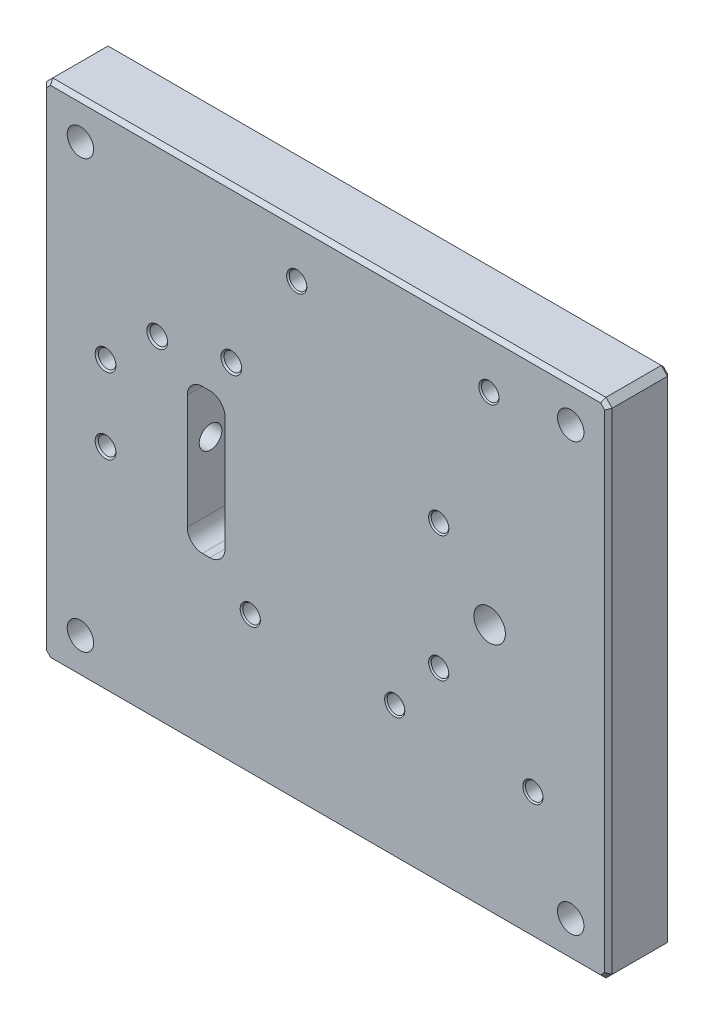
ISO-10303-21;
HEADER;
FILE_DESCRIPTION(('STEP AP214'),'2;1');
FILE_NAME('part.step','',(''),(''),'','','');
FILE_SCHEMA(('AUTOMOTIVE_DESIGN { 1 0 10303 214 1 1 1 1 }'));
ENDSEC;
DATA;
#1=APPLICATION_CONTEXT('core data for automotive mechanical design processes');
#2=APPLICATION_PROTOCOL_DEFINITION('international standard','automotive_design',2000,#1);
#3=PRODUCT_CONTEXT('',#1,'mechanical');
#4=PRODUCT('Part','Part','',(#3));
#5=PRODUCT_RELATED_PRODUCT_CATEGORY('part','',(#4));
#6=PRODUCT_DEFINITION_FORMATION('','',#4);
#7=PRODUCT_DEFINITION_CONTEXT('part definition',#1,'design');
#8=PRODUCT_DEFINITION('design','',#6,#7);
#9=PRODUCT_DEFINITION_SHAPE('','',#8);
#10=(LENGTH_UNIT() NAMED_UNIT(*) SI_UNIT(.MILLI.,.METRE.));
#11=(NAMED_UNIT(*) PLANE_ANGLE_UNIT() SI_UNIT($,.RADIAN.));
#12=(NAMED_UNIT(*) SI_UNIT($,.STERADIAN.) SOLID_ANGLE_UNIT());
#13=UNCERTAINTY_MEASURE_WITH_UNIT(LENGTH_MEASURE(1.E-05),#10,'distance_accuracy_value','');
#14=(GEOMETRIC_REPRESENTATION_CONTEXT(3) GLOBAL_UNCERTAINTY_ASSIGNED_CONTEXT((#13)) GLOBAL_UNIT_ASSIGNED_CONTEXT((#10,
#11,#12)) REPRESENTATION_CONTEXT('',''));
#15=CARTESIAN_POINT('',(0.,0.,0.));
#16=DIRECTION('',(0.,0.,1.));
#17=DIRECTION('',(1.,0.,0.));
#18=AXIS2_PLACEMENT_3D('',#15,#16,#17);
#19=CARTESIAN_POINT('',(75.502,0.,-50.));
#20=DIRECTION('',(0.,0.,-1.));
#21=DIRECTION('',(-1.,0.,0.));
#22=AXIS2_PLACEMENT_3D('',#19,#20,#21);
#23=CYLINDRICAL_SURFACE('',#22,8.74999999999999);
#24=CARTESIAN_POINT('',(75.502,0.,-34.));
#25=DIRECTION('',(0.,0.,-1.));
#26=DIRECTION('',(-1.,0.,0.));
#27=AXIS2_PLACEMENT_3D('',#24,#25,#26);
#28=CIRCLE('',#27,8.74999999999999);
#29=CARTESIAN_POINT('',(66.752,0.,-34.));
#30=VERTEX_POINT('',#29);
#31=EDGE_CURVE('E407',#30,#30,#28,.T.);
#32=ORIENTED_EDGE('',*,*,#31,.T.);
#33=EDGE_LOOP('',(#32));
#34=FACE_BOUND('',#33,.T.);
#35=CARTESIAN_POINT('',(75.502,0.,-18.));
#36=DIRECTION('',(0.,0.,1.));
#37=DIRECTION('',(1.,0.,0.));
#38=AXIS2_PLACEMENT_3D('',#35,#36,#37);
#39=CIRCLE('',#38,8.74999999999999);
#40=CARTESIAN_POINT('',(84.252,0.,-18.));
#41=VERTEX_POINT('',#40);
#42=EDGE_CURVE('E395',#41,#41,#39,.F.);
#43=ORIENTED_EDGE('',*,*,#42,.F.);
#44=EDGE_LOOP('',(#43));
#45=FACE_BOUND('',#44,.T.);
#46=ADVANCED_FACE('F36',(#34,#45),#23,.F.);
#47=CARTESIAN_POINT('',(-280.,200.,-50.));
#48=DIRECTION('',(0.,0.,-1.));
#49=DIRECTION('',(-1.,0.,0.));
#50=AXIS2_PLACEMENT_3D('',#47,#48,#49);
#51=PLANE('',#50);
#52=DIRECTION('',(0.,1.,0.));
#53=VECTOR('',#52,1.);
#54=CARTESIAN_POINT('',(-277.,195.,-50.));
#55=LINE('',#54,#53);
#56=CARTESIAN_POINT('',(-277.,-193.757359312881,-50.));
#57=VERTEX_POINT('',#56);
#58=CARTESIAN_POINT('',(-277.,193.757359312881,-50.));
#59=VERTEX_POINT('',#58);
#60=EDGE_CURVE('E492',#57,#59,#55,.T.);
#61=ORIENTED_EDGE('',*,*,#60,.T.);
#62=DIRECTION('',(0.707106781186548,0.707106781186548,0.));
#63=VECTOR('',#62,1.);
#64=CARTESIAN_POINT('',(-272.87867965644,197.87867965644,-50.));
#65=LINE('',#64,#63);
#66=CARTESIAN_POINT('',(-273.757359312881,197.,-50.));
#67=VERTEX_POINT('',#66);
#68=EDGE_CURVE('E494',#59,#67,#65,.T.);
#69=ORIENTED_EDGE('',*,*,#68,.T.);
#70=DIRECTION('',(1.,0.,0.));
#71=VECTOR('',#70,1.);
#72=CARTESIAN_POINT('',(165.,197.,-50.));
#73=LINE('',#72,#71);
#74=CARTESIAN_POINT('',(163.757359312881,197.,-50.));
#75=VERTEX_POINT('',#74);
#76=EDGE_CURVE('E484',#67,#75,#73,.T.);
#77=ORIENTED_EDGE('',*,*,#76,.T.);
#78=DIRECTION('',(0.707106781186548,-0.707106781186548,0.));
#79=VECTOR('',#78,1.);
#80=CARTESIAN_POINT('',(167.87867965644,192.87867965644,-50.));
#81=LINE('',#80,#79);
#82=CARTESIAN_POINT('',(167.,193.757359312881,-50.));
#83=VERTEX_POINT('',#82);
#84=EDGE_CURVE('E476',#75,#83,#81,.T.);
#85=ORIENTED_EDGE('',*,*,#84,.T.);
#86=DIRECTION('',(0.,-1.,0.));
#87=VECTOR('',#86,1.);
#88=CARTESIAN_POINT('',(167.,-195.,-50.));
#89=LINE('',#88,#87);
#90=CARTESIAN_POINT('',(167.,-193.757359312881,-50.));
#91=VERTEX_POINT('',#90);
#92=EDGE_CURVE('E482',#83,#91,#89,.T.);
#93=ORIENTED_EDGE('',*,*,#92,.T.);
#94=DIRECTION('',(-0.707106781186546,-0.707106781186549,0.));
#95=VECTOR('',#94,1.);
#96=CARTESIAN_POINT('',(162.87867965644,-197.87867965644,-50.));
#97=LINE('',#96,#95);
#98=CARTESIAN_POINT('',(163.757359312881,-197.,-50.));
#99=VERTEX_POINT('',#98);
#100=EDGE_CURVE('E486',#91,#99,#97,.T.);
#101=ORIENTED_EDGE('',*,*,#100,.T.);
#102=DIRECTION('',(-1.,0.,0.));
#103=VECTOR('',#102,1.);
#104=CARTESIAN_POINT('',(-275.,-197.,-50.));
#105=LINE('',#104,#103);
#106=CARTESIAN_POINT('',(-273.757359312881,-197.,-50.));
#107=VERTEX_POINT('',#106);
#108=EDGE_CURVE('E488',#99,#107,#105,.T.);
#109=ORIENTED_EDGE('',*,*,#108,.T.);
#110=DIRECTION('',(-0.707106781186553,0.707106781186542,0.));
#111=VECTOR('',#110,1.);
#112=CARTESIAN_POINT('',(-277.87867965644,-192.87867965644,-50.));
#113=LINE('',#112,#111);
#114=EDGE_CURVE('E490',#107,#57,#113,.T.);
#115=ORIENTED_EDGE('',*,*,#114,.T.);
#116=EDGE_LOOP('',(#61,#69,#77,#85,#93,#101,#109,#115));
#117=FACE_BOUND('',#116,.T.);
#118=CARTESIAN_POINT('',(75.502,0.,-50.));
#119=DIRECTION('',(0.,0.,-1.));
#120=DIRECTION('',(-1.,0.,0.));
#121=AXIS2_PLACEMENT_3D('',#118,#119,#120);
#122=CIRCLE('',#121,13.75);
#123=CARTESIAN_POINT('',(61.752,0.,-50.));
#124=VERTEX_POINT('',#123);
#125=EDGE_CURVE('E398',#124,#124,#122,.T.);
#126=ORIENTED_EDGE('',*,*,#125,.F.);
#127=EDGE_LOOP('',(#126));
#128=FACE_BOUND('',#127,.T.);
#129=CARTESIAN_POINT('',(-250.,170.,-50.));
#130=DIRECTION('',(0.,0.,-1.));
#131=DIRECTION('',(1.,0.,0.));
#132=AXIS2_PLACEMENT_3D('',#129,#130,#131);
#133=CIRCLE('',#132,10.5);
#134=CARTESIAN_POINT('',(-239.5,170.,-50.));
#135=VERTEX_POINT('',#134);
#136=EDGE_CURVE('E435',#135,#135,#133,.T.);
#137=ORIENTED_EDGE('',*,*,#136,.F.);
#138=EDGE_LOOP('',(#137));
#139=FACE_BOUND('',#138,.T.);
#140=CARTESIAN_POINT('',(-250.,-170.,-50.));
#141=DIRECTION('',(0.,0.,-1.));
#142=DIRECTION('',(1.,0.,0.));
#143=AXIS2_PLACEMENT_3D('',#140,#141,#142);
#144=CIRCLE('',#143,10.5);
#145=CARTESIAN_POINT('',(-239.5,-170.,-50.));
#146=VERTEX_POINT('',#145);
#147=EDGE_CURVE('E447',#146,#146,#144,.T.);
#148=ORIENTED_EDGE('',*,*,#147,.F.);
#149=EDGE_LOOP('',(#148));
#150=FACE_BOUND('',#149,.T.);
#151=CARTESIAN_POINT('',(140.,-170.,-50.));
#152=DIRECTION('',(0.,0.,-1.));
#153=DIRECTION('',(1.,0.,0.));
#154=AXIS2_PLACEMENT_3D('',#151,#152,#153);
#155=CIRCLE('',#154,10.5);
#156=CARTESIAN_POINT('',(150.5,-170.,-50.));
#157=VERTEX_POINT('',#156);
#158=EDGE_CURVE('E441',#157,#157,#155,.T.);
#159=ORIENTED_EDGE('',*,*,#158,.F.);
#160=EDGE_LOOP('',(#159));
#161=FACE_BOUND('',#160,.T.);
#162=CARTESIAN_POINT('',(140.,170.,-50.));
#163=DIRECTION('',(0.,0.,-1.));
#164=DIRECTION('',(1.,0.,0.));
#165=AXIS2_PLACEMENT_3D('',#162,#163,#164);
#166=CIRCLE('',#165,10.5);
#167=CARTESIAN_POINT('',(150.5,170.,-50.));
#168=VERTEX_POINT('',#167);
#169=EDGE_CURVE('E429',#168,#168,#166,.T.);
#170=ORIENTED_EDGE('',*,*,#169,.F.);
#171=EDGE_LOOP('',(#170));
#172=FACE_BOUND('',#171,.T.);
#173=ADVANCED_FACE('F691',(#117,#128,#139,#150,#161,#172),#51,.T.);
#174=CARTESIAN_POINT('',(-280.,200.,0.));
#175=DIRECTION('',(0.,0.,-1.));
#176=DIRECTION('',(-1.,0.,0.));
#177=AXIS2_PLACEMENT_3D('',#174,#175,#176);
#178=PLANE('',#177);
#179=DIRECTION('',(0.,1.,0.));
#180=VECTOR('',#179,1.);
#181=CARTESIAN_POINT('',(167.,200.,0.));
#182=LINE('',#181,#180);
#183=CARTESIAN_POINT('',(167.,-193.757359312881,0.));
#184=VERTEX_POINT('',#183);
#185=CARTESIAN_POINT('',(167.,193.757359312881,0.));
#186=VERTEX_POINT('',#185);
#187=EDGE_CURVE('E45',#184,#186,#182,.T.);
#188=ORIENTED_EDGE('',*,*,#187,.T.);
#189=DIRECTION('',(-0.707106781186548,0.707106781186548,0.));
#190=VECTOR('',#189,1.);
#191=CARTESIAN_POINT('',(-59.6213203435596,420.37867965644,0.));
#192=LINE('',#191,#190);
#193=CARTESIAN_POINT('',(163.757359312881,197.,0.));
#194=VERTEX_POINT('',#193);
#195=EDGE_CURVE('E11',#186,#194,#192,.T.);
#196=ORIENTED_EDGE('',*,*,#195,.T.);
#197=DIRECTION('',(-1.,0.,0.));
#198=VECTOR('',#197,1.);
#199=CARTESIAN_POINT('',(-280.,197.,0.));
#200=LINE('',#199,#198);
#201=CARTESIAN_POINT('',(-273.757359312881,197.,0.));
#202=VERTEX_POINT('',#201);
#203=EDGE_CURVE('E531',#194,#202,#200,.T.);
#204=ORIENTED_EDGE('',*,*,#203,.T.);
#205=DIRECTION('',(-0.707106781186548,-0.707106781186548,0.));
#206=VECTOR('',#205,1.);
#207=CARTESIAN_POINT('',(-275.37867965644,195.37867965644,0.));
#208=LINE('',#207,#206);
#209=CARTESIAN_POINT('',(-277.,193.757359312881,0.));
#210=VERTEX_POINT('',#209);
#211=EDGE_CURVE('E533',#202,#210,#208,.T.);
#212=ORIENTED_EDGE('',*,*,#211,.T.);
#213=DIRECTION('',(0.,-1.,0.));
#214=VECTOR('',#213,1.);
#215=CARTESIAN_POINT('',(-277.,200.,0.));
#216=LINE('',#215,#214);
#217=CARTESIAN_POINT('',(-277.,-193.757359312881,0.));
#218=VERTEX_POINT('',#217);
#219=EDGE_CURVE('E535',#210,#218,#216,.T.);
#220=ORIENTED_EDGE('',*,*,#219,.T.);
#221=DIRECTION('',(0.707106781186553,-0.707106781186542,0.));
#222=VECTOR('',#221,1.);
#223=CARTESIAN_POINT('',(-475.37867965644,4.62132034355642,0.));
#224=LINE('',#223,#222);
#225=CARTESIAN_POINT('',(-273.757359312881,-197.,0.));
#226=VERTEX_POINT('',#225);
#227=EDGE_CURVE('E537',#218,#226,#224,.T.);
#228=ORIENTED_EDGE('',*,*,#227,.T.);
#229=DIRECTION('',(1.,0.,0.));
#230=VECTOR('',#229,1.);
#231=CARTESIAN_POINT('',(-280.,-197.,0.));
#232=LINE('',#231,#230);
#233=CARTESIAN_POINT('',(163.757359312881,-197.,0.));
#234=VERTEX_POINT('',#233);
#235=EDGE_CURVE('E539',#226,#234,#232,.T.);
#236=ORIENTED_EDGE('',*,*,#235,.T.);
#237=DIRECTION('',(0.707106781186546,0.707106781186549,0.));
#238=VECTOR('',#237,1.);
#239=CARTESIAN_POINT('',(140.378679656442,-220.378679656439,0.));
#240=LINE('',#239,#238);
#241=EDGE_CURVE('E56',#234,#184,#240,.T.);
#242=ORIENTED_EDGE('',*,*,#241,.T.);
#243=EDGE_LOOP('',(#188,#196,#204,#212,#220,#228,#236,#242));
#244=FACE_BOUND('',#243,.T.);
#245=CARTESIAN_POINT('',(-230.,30.,0.));
#246=DIRECTION('',(0.,0.,1.));
#247=DIRECTION('',(1.,0.,0.));
#248=AXIS2_PLACEMENT_3D('',#245,#246,#247);
#249=CIRCLE('',#248,8.25000000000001);
#250=CARTESIAN_POINT('',(-221.75,30.,0.));
#251=VERTEX_POINT('',#250);
#252=EDGE_CURVE('E245',#251,#251,#249,.T.);
#253=ORIENTED_EDGE('',*,*,#252,.F.);
#254=EDGE_LOOP('',(#253));
#255=FACE_BOUND('',#254,.T.);
#256=CARTESIAN_POINT('',(-130.,78.,0.));
#257=DIRECTION('',(0.,0.,1.));
#258=DIRECTION('',(1.,0.,0.));
#259=AXIS2_PLACEMENT_3D('',#256,#257,#258);
#260=CIRCLE('',#259,8.25000000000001);
#261=CARTESIAN_POINT('',(-121.75,78.,0.));
#262=VERTEX_POINT('',#261);
#263=EDGE_CURVE('E238',#262,#262,#260,.T.);
#264=ORIENTED_EDGE('',*,*,#263,.F.);
#265=EDGE_LOOP('',(#264));
#266=FACE_BOUND('',#265,.T.);
#267=CARTESIAN_POINT('',(-188.891628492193,66.5206231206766,0.));
#268=DIRECTION('',(0.,0.,1.));
#269=DIRECTION('',(1.,0.,0.));
#270=AXIS2_PLACEMENT_3D('',#267,#268,#269);
#271=CIRCLE('',#270,8.25000000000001);
#272=CARTESIAN_POINT('',(-180.641628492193,66.5206231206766,0.));
#273=VERTEX_POINT('',#272);
#274=EDGE_CURVE('E254',#273,#273,#271,.T.);
#275=ORIENTED_EDGE('',*,*,#274,.F.);
#276=EDGE_LOOP('',(#275));
#277=FACE_BOUND('',#276,.T.);
#278=CARTESIAN_POINT('',(-230.,-30.,0.));
#279=DIRECTION('',(0.,0.,1.));
#280=DIRECTION('',(1.,0.,0.));
#281=AXIS2_PLACEMENT_3D('',#278,#279,#280);
#282=CIRCLE('',#281,8.25000000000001);
#283=CARTESIAN_POINT('',(-221.75,-30.,0.));
#284=VERTEX_POINT('',#283);
#285=EDGE_CURVE('E263',#284,#284,#282,.T.);
#286=ORIENTED_EDGE('',*,*,#285,.F.);
#287=EDGE_LOOP('',(#286));
#288=FACE_BOUND('',#287,.T.);
#289=CARTESIAN_POINT('',(-77.926241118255,160.,0.));
#290=DIRECTION('',(0.,0.,1.));
#291=DIRECTION('',(1.,0.,0.));
#292=AXIS2_PLACEMENT_3D('',#289,#290,#291);
#293=CIRCLE('',#292,8.025);
#294=CARTESIAN_POINT('',(-69.901241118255,160.,0.));
#295=VERTEX_POINT('',#294);
#296=EDGE_CURVE('E272',#295,#295,#293,.T.);
#297=ORIENTED_EDGE('',*,*,#296,.F.);
#298=EDGE_LOOP('',(#297));
#299=FACE_BOUND('',#298,.T.);
#300=CARTESIAN_POINT('',(74.9290779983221,160.,0.));
#301=DIRECTION('',(0.,0.,1.));
#302=DIRECTION('',(1.,0.,0.));
#303=AXIS2_PLACEMENT_3D('',#300,#301,#302);
#304=CIRCLE('',#303,8.025);
#305=CARTESIAN_POINT('',(82.9540779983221,160.,0.));
#306=VERTEX_POINT('',#305);
#307=EDGE_CURVE('E281',#306,#306,#304,.T.);
#308=ORIENTED_EDGE('',*,*,#307,.F.);
#309=EDGE_LOOP('',(#308));
#310=FACE_BOUND('',#309,.T.);
#311=CARTESIAN_POINT('',(-114.891252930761,-88.,0.));
#312=DIRECTION('',(0.,0.,1.));
#313=DIRECTION('',(1.,0.,0.));
#314=AXIS2_PLACEMENT_3D('',#311,#312,#313);
#315=CIRCLE('',#314,8.025);
#316=CARTESIAN_POINT('',(-106.866252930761,-88.,0.));
#317=VERTEX_POINT('',#316);
#318=EDGE_CURVE('E290',#317,#317,#315,.T.);
#319=ORIENTED_EDGE('',*,*,#318,.F.);
#320=EDGE_LOOP('',(#319));
#321=FACE_BOUND('',#320,.T.);
#322=CARTESIAN_POINT('',(0.,-93.,0.));
#323=DIRECTION('',(0.,0.,1.));
#324=DIRECTION('',(1.,0.,0.));
#325=AXIS2_PLACEMENT_3D('',#322,#323,#324);
#326=CIRCLE('',#325,8.025);
#327=CARTESIAN_POINT('',(8.025,-93.,0.));
#328=VERTEX_POINT('',#327);
#329=EDGE_CURVE('E299',#328,#328,#326,.T.);
#330=ORIENTED_EDGE('',*,*,#329,.F.);
#331=EDGE_LOOP('',(#330));
#332=FACE_BOUND('',#331,.T.);
#333=CARTESIAN_POINT('',(109.895981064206,-97.7826086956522,0.));
#334=DIRECTION('',(0.,0.,1.));
#335=DIRECTION('',(1.,0.,0.));
#336=AXIS2_PLACEMENT_3D('',#333,#334,#335);
#337=CIRCLE('',#336,8.025);
#338=CARTESIAN_POINT('',(117.920981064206,-97.7826086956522,0.));
#339=VERTEX_POINT('',#338);
#340=EDGE_CURVE('E308',#339,#339,#337,.T.);
#341=ORIENTED_EDGE('',*,*,#340,.F.);
#342=EDGE_LOOP('',(#341));
#343=FACE_BOUND('',#342,.T.);
#344=DIRECTION('',(1.,0.,0.));
#345=VECTOR('',#344,1.);
#346=CARTESIAN_POINT('',(-153.,-65.,0.));
#347=LINE('',#346,#345);
#348=CARTESIAN_POINT('',(-153.,-65.,0.));
#349=VERTEX_POINT('',#348);
#350=CARTESIAN_POINT('',(-147.,-65.,0.));
#351=VERTEX_POINT('',#350);
#352=EDGE_CURVE('E355',#349,#351,#347,.T.);
#353=ORIENTED_EDGE('',*,*,#352,.F.);
#354=CARTESIAN_POINT('',(-153.,-53.,0.));
#355=DIRECTION('',(0.,0.,1.));
#356=DIRECTION('',(1.,0.,0.));
#357=AXIS2_PLACEMENT_3D('',#354,#355,#356);
#358=CIRCLE('',#357,12.);
#359=CARTESIAN_POINT('',(-165.,-53.,0.));
#360=VERTEX_POINT('',#359);
#361=EDGE_CURVE('E327',#360,#349,#358,.T.);
#362=ORIENTED_EDGE('',*,*,#361,.F.);
#363=DIRECTION('',(0.,-1.,0.));
#364=VECTOR('',#363,1.);
#365=CARTESIAN_POINT('',(-165.,38.,0.));
#366=LINE('',#365,#364);
#367=CARTESIAN_POINT('',(-165.,38.,0.));
#368=VERTEX_POINT('',#367);
#369=EDGE_CURVE('E332',#368,#360,#366,.T.);
#370=ORIENTED_EDGE('',*,*,#369,.F.);
#371=CARTESIAN_POINT('',(-153.,38.,0.));
#372=DIRECTION('',(0.,0.,1.));
#373=DIRECTION('',(1.,0.,0.));
#374=AXIS2_PLACEMENT_3D('',#371,#372,#373);
#375=CIRCLE('',#374,12.);
#376=CARTESIAN_POINT('',(-153.,50.,0.));
#377=VERTEX_POINT('',#376);
#378=EDGE_CURVE('E370',#377,#368,#375,.T.);
#379=ORIENTED_EDGE('',*,*,#378,.F.);
#380=DIRECTION('',(-1.,0.,0.));
#381=VECTOR('',#380,1.);
#382=CARTESIAN_POINT('',(-153.,50.,0.));
#383=LINE('',#382,#381);
#384=CARTESIAN_POINT('',(-147.,50.,0.));
#385=VERTEX_POINT('',#384);
#386=EDGE_CURVE('E367',#385,#377,#383,.T.);
#387=ORIENTED_EDGE('',*,*,#386,.F.);
#388=CARTESIAN_POINT('',(-147.,38.,0.));
#389=DIRECTION('',(0.,0.,1.));
#390=DIRECTION('',(-1.,0.,0.));
#391=AXIS2_PLACEMENT_3D('',#388,#389,#390);
#392=CIRCLE('',#391,12.);
#393=CARTESIAN_POINT('',(-135.,38.,0.));
#394=VERTEX_POINT('',#393);
#395=EDGE_CURVE('E364',#394,#385,#392,.T.);
#396=ORIENTED_EDGE('',*,*,#395,.F.);
#397=DIRECTION('',(0.,1.,0.));
#398=VECTOR('',#397,1.);
#399=CARTESIAN_POINT('',(-135.,38.,0.));
#400=LINE('',#399,#398);
#401=CARTESIAN_POINT('',(-135.,-53.,0.));
#402=VERTEX_POINT('',#401);
#403=EDGE_CURVE('E361',#402,#394,#400,.T.);
#404=ORIENTED_EDGE('',*,*,#403,.F.);
#405=CARTESIAN_POINT('',(-147.,-53.,0.));
#406=DIRECTION('',(0.,0.,1.));
#407=DIRECTION('',(1.,0.,0.));
#408=AXIS2_PLACEMENT_3D('',#405,#406,#407);
#409=CIRCLE('',#408,12.);
#410=EDGE_CURVE('E358',#351,#402,#409,.T.);
#411=ORIENTED_EDGE('',*,*,#410,.F.);
#412=EDGE_LOOP('',(#353,#362,#370,#379,#387,#396,#404,#411));
#413=FACE_BOUND('',#412,.T.);
#414=CARTESIAN_POINT('',(75.502,0.,0.));
#415=DIRECTION('',(0.,0.,1.));
#416=DIRECTION('',(1.,0.,0.));
#417=AXIS2_PLACEMENT_3D('',#414,#415,#416);
#418=CIRCLE('',#417,12.5);
#419=CARTESIAN_POINT('',(88.002,0.,0.));
#420=VERTEX_POINT('',#419);
#421=EDGE_CURVE('E377',#420,#420,#418,.T.);
#422=ORIENTED_EDGE('',*,*,#421,.F.);
#423=EDGE_LOOP('',(#422));
#424=FACE_BOUND('',#423,.T.);
#425=CARTESIAN_POINT('',(35.,50.,0.));
#426=DIRECTION('',(0.,0.,1.));
#427=DIRECTION('',(1.,0.,0.));
#428=AXIS2_PLACEMENT_3D('',#425,#426,#427);
#429=CIRCLE('',#428,8.025);
#430=CARTESIAN_POINT('',(43.025,50.,0.));
#431=VERTEX_POINT('',#430);
#432=EDGE_CURVE('E410',#431,#431,#429,.T.);
#433=ORIENTED_EDGE('',*,*,#432,.F.);
#434=EDGE_LOOP('',(#433));
#435=FACE_BOUND('',#434,.T.);
#436=CARTESIAN_POINT('',(35.,-50.,0.));
#437=DIRECTION('',(0.,0.,1.));
#438=DIRECTION('',(1.,0.,0.));
#439=AXIS2_PLACEMENT_3D('',#436,#437,#438);
#440=CIRCLE('',#439,8.025);
#441=CARTESIAN_POINT('',(43.025,-50.,0.));
#442=VERTEX_POINT('',#441);
#443=EDGE_CURVE('E419',#442,#442,#440,.T.);
#444=ORIENTED_EDGE('',*,*,#443,.F.);
#445=EDGE_LOOP('',(#444));
#446=FACE_BOUND('',#445,.T.);
#447=CARTESIAN_POINT('',(-250.,170.,0.));
#448=DIRECTION('',(0.,0.,-1.));
#449=DIRECTION('',(1.,0.,0.));
#450=AXIS2_PLACEMENT_3D('',#447,#448,#449);
#451=CIRCLE('',#450,10.5);
#452=CARTESIAN_POINT('',(-239.5,170.,0.));
#453=VERTEX_POINT('',#452);
#454=EDGE_CURVE('E432',#453,#453,#451,.T.);
#455=ORIENTED_EDGE('',*,*,#454,.T.);
#456=EDGE_LOOP('',(#455));
#457=FACE_BOUND('',#456,.T.);
#458=CARTESIAN_POINT('',(-250.,-170.,0.));
#459=DIRECTION('',(0.,0.,-1.));
#460=DIRECTION('',(1.,0.,0.));
#461=AXIS2_PLACEMENT_3D('',#458,#459,#460);
#462=CIRCLE('',#461,10.5);
#463=CARTESIAN_POINT('',(-239.5,-170.,0.));
#464=VERTEX_POINT('',#463);
#465=EDGE_CURVE('E444',#464,#464,#462,.T.);
#466=ORIENTED_EDGE('',*,*,#465,.T.);
#467=EDGE_LOOP('',(#466));
#468=FACE_BOUND('',#467,.T.);
#469=CARTESIAN_POINT('',(140.,-170.,0.));
#470=DIRECTION('',(0.,0.,-1.));
#471=DIRECTION('',(1.,0.,0.));
#472=AXIS2_PLACEMENT_3D('',#469,#470,#471);
#473=CIRCLE('',#472,10.5);
#474=CARTESIAN_POINT('',(150.5,-170.,0.));
#475=VERTEX_POINT('',#474);
#476=EDGE_CURVE('E438',#475,#475,#473,.T.);
#477=ORIENTED_EDGE('',*,*,#476,.T.);
#478=EDGE_LOOP('',(#477));
#479=FACE_BOUND('',#478,.T.);
#480=CARTESIAN_POINT('',(140.,170.,0.));
#481=DIRECTION('',(0.,0.,-1.));
#482=DIRECTION('',(1.,0.,0.));
#483=AXIS2_PLACEMENT_3D('',#480,#481,#482);
#484=CIRCLE('',#483,10.5);
#485=CARTESIAN_POINT('',(150.5,170.,0.));
#486=VERTEX_POINT('',#485);
#487=EDGE_CURVE('E428',#486,#486,#484,.T.);
#488=ORIENTED_EDGE('',*,*,#487,.T.);
#489=EDGE_LOOP('',(#488));
#490=FACE_BOUND('',#489,.T.);
#491=ADVANCED_FACE('F596',(#244,#255,#266,#277,#288,#299,#310,#321,#332,#343,#413,#424,#435,
#446,#457,#468,#479,#490),#178,.F.);
#492=CARTESIAN_POINT('',(-280.,-195.,-50.));
#493=DIRECTION('',(1.,0.,0.));
#494=DIRECTION('',(0.,1.,0.));
#495=AXIS2_PLACEMENT_3D('',#492,#493,#494);
#496=PLANE('',#495);
#497=CARTESIAN_POINT('',(-280.,0.,-18.5));
#498=DIRECTION('',(1.,0.,0.));
#499=DIRECTION('',(0.,0.,-1.));
#500=AXIS2_PLACEMENT_3D('',#497,#498,#499);
#501=CIRCLE('',#500,9.);
#502=CARTESIAN_POINT('',(-280.,0.,-27.5));
#503=VERTEX_POINT('',#502);
#504=EDGE_CURVE('E320',#503,#503,#501,.T.);
#505=ORIENTED_EDGE('',*,*,#504,.T.);
#506=EDGE_LOOP('',(#505));
#507=FACE_BOUND('',#506,.T.);
#508=DIRECTION('',(0.,0.,1.));
#509=VECTOR('',#508,1.);
#510=CARTESIAN_POINT('',(-280.,195.,-50.));
#511=LINE('',#510,#509);
#512=CARTESIAN_POINT('',(-280.,195.,-47.0000000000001));
#513=VERTEX_POINT('',#512);
#514=CARTESIAN_POINT('',(-280.,195.,-2.99999999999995));
#515=VERTEX_POINT('',#514);
#516=EDGE_CURVE('E473',#513,#515,#511,.T.);
#517=ORIENTED_EDGE('',*,*,#516,.F.);
#518=DIRECTION('',(0.,-1.,0.));
#519=VECTOR('',#518,1.);
#520=CARTESIAN_POINT('',(-280.,-195.,-47.0000000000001));
#521=LINE('',#520,#519);
#522=CARTESIAN_POINT('',(-280.,-195.,-47.0000000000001));
#523=VERTEX_POINT('',#522);
#524=EDGE_CURVE('E504',#513,#523,#521,.T.);
#525=ORIENTED_EDGE('',*,*,#524,.T.);
#526=DIRECTION('',(0.,0.,1.));
#527=VECTOR('',#526,1.);
#528=CARTESIAN_POINT('',(-280.,-195.,-50.));
#529=LINE('',#528,#527);
#530=CARTESIAN_POINT('',(-280.,-195.,-2.99999999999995));
#531=VERTEX_POINT('',#530);
#532=EDGE_CURVE('E450',#523,#531,#529,.T.);
#533=ORIENTED_EDGE('',*,*,#532,.T.);
#534=DIRECTION('',(0.,1.,0.));
#535=VECTOR('',#534,1.);
#536=CARTESIAN_POINT('',(-280.,-195.,-2.99999999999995));
#537=LINE('',#536,#535);
#538=EDGE_CURVE('E502',#531,#515,#537,.T.);
#539=ORIENTED_EDGE('',*,*,#538,.T.);
#540=EDGE_LOOP('',(#517,#525,#533,#539));
#541=FACE_BOUND('',#540,.T.);
#542=ADVANCED_FACE('F643',(#507,#541),#496,.F.);
#543=CARTESIAN_POINT('',(-280.,195.,-50.));
#544=DIRECTION('',(0.707106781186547,-0.707106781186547,0.));
#545=DIRECTION('',(0.707106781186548,0.707106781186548,0.));
#546=AXIS2_PLACEMENT_3D('',#543,#544,#545);
#547=PLANE('',#546);
#548=DIRECTION('',(0.,0.,1.));
#549=VECTOR('',#548,1.);
#550=CARTESIAN_POINT('',(-275.,200.,-50.));
#551=LINE('',#550,#549);
#552=CARTESIAN_POINT('',(-275.,200.,-47.0000000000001));
#553=VERTEX_POINT('',#552);
#554=CARTESIAN_POINT('',(-275.,200.,-2.99999999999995));
#555=VERTEX_POINT('',#554);
#556=EDGE_CURVE('E470',#553,#555,#551,.T.);
#557=ORIENTED_EDGE('',*,*,#556,.F.);
#558=DIRECTION('',(-0.707106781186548,-0.707106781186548,0.));
#559=VECTOR('',#558,1.);
#560=CARTESIAN_POINT('',(-280.,195.,-47.0000000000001));
#561=LINE('',#560,#559);
#562=EDGE_CURVE('E499',#553,#513,#561,.T.);
#563=ORIENTED_EDGE('',*,*,#562,.T.);
#564=ORIENTED_EDGE('',*,*,#516,.T.);
#565=DIRECTION('',(0.707106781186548,0.707106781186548,0.));
#566=VECTOR('',#565,1.);
#567=CARTESIAN_POINT('',(-280.,195.,-2.99999999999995));
#568=LINE('',#567,#566);
#569=EDGE_CURVE('E497',#515,#555,#568,.T.);
#570=ORIENTED_EDGE('',*,*,#569,.T.);
#571=EDGE_LOOP('',(#557,#563,#564,#570));
#572=FACE_BOUND('',#571,.T.);
#573=ADVANCED_FACE('F630',(#572),#547,.F.);
#574=CARTESIAN_POINT('',(-275.,200.,-50.));
#575=DIRECTION('',(0.,-1.,0.));
#576=DIRECTION('',(0.,0.,-1.));
#577=AXIS2_PLACEMENT_3D('',#574,#575,#576);
#578=PLANE('',#577);
#579=DIRECTION('',(0.,0.,1.));
#580=VECTOR('',#579,1.);
#581=CARTESIAN_POINT('',(165.,200.,-50.));
#582=LINE('',#581,#580);
#583=CARTESIAN_POINT('',(165.,200.,-47.0000000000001));
#584=VERTEX_POINT('',#583);
#585=CARTESIAN_POINT('',(165.,200.,-2.99999999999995));
#586=VERTEX_POINT('',#585);
#587=EDGE_CURVE('E467',#584,#586,#582,.T.);
#588=ORIENTED_EDGE('',*,*,#587,.F.);
#589=DIRECTION('',(-1.,0.,0.));
#590=VECTOR('',#589,1.);
#591=CARTESIAN_POINT('',(-275.,200.,-47.0000000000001));
#592=LINE('',#591,#590);
#593=EDGE_CURVE('E520',#584,#553,#592,.T.);
#594=ORIENTED_EDGE('',*,*,#593,.T.);
#595=ORIENTED_EDGE('',*,*,#556,.T.);
#596=DIRECTION('',(1.,0.,0.));
#597=VECTOR('',#596,1.);
#598=CARTESIAN_POINT('',(-275.,200.,-2.99999999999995));
#599=LINE('',#598,#597);
#600=EDGE_CURVE('E518',#555,#586,#599,.T.);
#601=ORIENTED_EDGE('',*,*,#600,.T.);
#602=EDGE_LOOP('',(#588,#594,#595,#601));
#603=FACE_BOUND('',#602,.T.);
#604=ADVANCED_FACE('F612',(#603),#578,.F.);
#605=CARTESIAN_POINT('',(165.,200.,-50.));
#606=DIRECTION('',(-0.707106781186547,-0.707106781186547,0.));
#607=DIRECTION('',(0.707106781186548,-0.707106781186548,0.));
#608=AXIS2_PLACEMENT_3D('',#605,#606,#607);
#609=PLANE('',#608);
#610=DIRECTION('',(0.,0.,1.));
#611=VECTOR('',#610,1.);
#612=CARTESIAN_POINT('',(170.,195.,-50.));
#613=LINE('',#612,#611);
#614=CARTESIAN_POINT('',(170.,195.,-47.0000000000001));
#615=VERTEX_POINT('',#614);
#616=CARTESIAN_POINT('',(170.,195.,-2.99999999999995));
#617=VERTEX_POINT('',#616);
#618=EDGE_CURVE('E464',#615,#617,#613,.T.);
#619=ORIENTED_EDGE('',*,*,#618,.F.);
#620=DIRECTION('',(-0.707106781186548,0.707106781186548,0.));
#621=VECTOR('',#620,1.);
#622=CARTESIAN_POINT('',(165.,200.,-47.0000000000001));
#623=LINE('',#622,#621);
#624=EDGE_CURVE('E529',#615,#584,#623,.T.);
#625=ORIENTED_EDGE('',*,*,#624,.T.);
#626=ORIENTED_EDGE('',*,*,#587,.T.);
#627=DIRECTION('',(0.707106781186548,-0.707106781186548,0.));
#628=VECTOR('',#627,1.);
#629=CARTESIAN_POINT('',(165.,200.,-2.99999999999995));
#630=LINE('',#629,#628);
#631=EDGE_CURVE('E526',#586,#617,#630,.T.);
#632=ORIENTED_EDGE('',*,*,#631,.T.);
#633=EDGE_LOOP('',(#619,#625,#626,#632));
#634=FACE_BOUND('',#633,.T.);
#635=ADVANCED_FACE('F617',(#634),#609,.F.);
#636=CARTESIAN_POINT('',(170.,195.,-50.));
#637=DIRECTION('',(-1.,0.,0.));
#638=DIRECTION('',(0.,0.,1.));
#639=AXIS2_PLACEMENT_3D('',#636,#637,#638);
#640=PLANE('',#639);
#641=DIRECTION('',(0.,0.,1.));
#642=VECTOR('',#641,1.);
#643=CARTESIAN_POINT('',(170.,-195.,-50.));
#644=LINE('',#643,#642);
#645=CARTESIAN_POINT('',(170.,-195.,-47.0000000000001));
#646=VERTEX_POINT('',#645);
#647=CARTESIAN_POINT('',(170.,-195.,-2.99999999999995));
#648=VERTEX_POINT('',#647);
#649=EDGE_CURVE('E461',#646,#648,#644,.T.);
#650=ORIENTED_EDGE('',*,*,#649,.F.);
#651=DIRECTION('',(0.,1.,0.));
#652=VECTOR('',#651,1.);
#653=CARTESIAN_POINT('',(170.,195.,-47.0000000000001));
#654=LINE('',#653,#652);
#655=EDGE_CURVE('E524',#646,#615,#654,.T.);
#656=ORIENTED_EDGE('',*,*,#655,.T.);
#657=ORIENTED_EDGE('',*,*,#618,.T.);
#658=DIRECTION('',(0.,-1.,0.));
#659=VECTOR('',#658,1.);
#660=CARTESIAN_POINT('',(170.,195.,-2.99999999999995));
#661=LINE('',#660,#659);
#662=EDGE_CURVE('E522',#617,#648,#661,.T.);
#663=ORIENTED_EDGE('',*,*,#662,.T.);
#664=EDGE_LOOP('',(#650,#656,#657,#663));
#665=FACE_BOUND('',#664,.T.);
#666=ADVANCED_FACE('F674',(#665),#640,.F.);
#667=CARTESIAN_POINT('',(170.,-195.,-50.));
#668=DIRECTION('',(-0.707106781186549,0.707106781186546,0.));
#669=DIRECTION('',(-0.707106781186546,-0.707106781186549,0.));
#670=AXIS2_PLACEMENT_3D('',#667,#668,#669);
#671=PLANE('',#670);
#672=DIRECTION('',(0.,0.,1.));
#673=VECTOR('',#672,1.);
#674=CARTESIAN_POINT('',(165.,-200.,-50.));
#675=LINE('',#674,#673);
#676=CARTESIAN_POINT('',(165.,-200.,-47.0000000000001));
#677=VERTEX_POINT('',#676);
#678=CARTESIAN_POINT('',(165.,-200.,-2.99999999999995));
#679=VERTEX_POINT('',#678);
#680=EDGE_CURVE('E458',#677,#679,#675,.T.);
#681=ORIENTED_EDGE('',*,*,#680,.F.);
#682=DIRECTION('',(0.707106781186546,0.707106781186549,0.));
#683=VECTOR('',#682,1.);
#684=CARTESIAN_POINT('',(170.,-195.,-47.0000000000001));
#685=LINE('',#684,#683);
#686=EDGE_CURVE('E516',#677,#646,#685,.T.);
#687=ORIENTED_EDGE('',*,*,#686,.T.);
#688=ORIENTED_EDGE('',*,*,#649,.T.);
#689=DIRECTION('',(-0.707106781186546,-0.707106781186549,0.));
#690=VECTOR('',#689,1.);
#691=CARTESIAN_POINT('',(170.,-195.,-2.99999999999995));
#692=LINE('',#691,#690);
#693=EDGE_CURVE('E514',#648,#679,#692,.T.);
#694=ORIENTED_EDGE('',*,*,#693,.T.);
#695=EDGE_LOOP('',(#681,#687,#688,#694));
#696=FACE_BOUND('',#695,.T.);
#697=ADVANCED_FACE('F662',(#696),#671,.F.);
#698=CARTESIAN_POINT('',(165.,-200.,-50.));
#699=DIRECTION('',(0.,1.,0.));
#700=DIRECTION('',(-1.,0.,0.));
#701=AXIS2_PLACEMENT_3D('',#698,#699,#700);
#702=PLANE('',#701);
#703=DIRECTION('',(0.,0.,1.));
#704=VECTOR('',#703,1.);
#705=CARTESIAN_POINT('',(-275.,-200.,-50.));
#706=LINE('',#705,#704);
#707=CARTESIAN_POINT('',(-275.,-200.,-47.0000000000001));
#708=VERTEX_POINT('',#707);
#709=CARTESIAN_POINT('',(-275.,-200.,-2.99999999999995));
#710=VERTEX_POINT('',#709);
#711=EDGE_CURVE('E455',#708,#710,#706,.T.);
#712=ORIENTED_EDGE('',*,*,#711,.F.);
#713=DIRECTION('',(1.,0.,0.));
#714=VECTOR('',#713,1.);
#715=CARTESIAN_POINT('',(165.,-200.,-47.0000000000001));
#716=LINE('',#715,#714);
#717=EDGE_CURVE('E512',#708,#677,#716,.T.);
#718=ORIENTED_EDGE('',*,*,#717,.T.);
#719=ORIENTED_EDGE('',*,*,#680,.T.);
#720=DIRECTION('',(-1.,0.,0.));
#721=VECTOR('',#720,1.);
#722=CARTESIAN_POINT('',(165.,-200.,-2.99999999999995));
#723=LINE('',#722,#721);
#724=EDGE_CURVE('E510',#679,#710,#723,.T.);
#725=ORIENTED_EDGE('',*,*,#724,.T.);
#726=EDGE_LOOP('',(#712,#718,#719,#725));
#727=FACE_BOUND('',#726,.T.);
#728=ADVANCED_FACE('F659',(#727),#702,.F.);
#729=CARTESIAN_POINT('',(-275.,-200.,-50.));
#730=DIRECTION('',(0.707106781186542,0.707106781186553,0.));
#731=DIRECTION('',(-0.707106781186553,0.707106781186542,0.));
#732=AXIS2_PLACEMENT_3D('',#729,#730,#731);
#733=PLANE('',#732);
#734=ORIENTED_EDGE('',*,*,#532,.F.);
#735=DIRECTION('',(0.707106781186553,-0.707106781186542,0.));
#736=VECTOR('',#735,1.);
#737=CARTESIAN_POINT('',(-275.,-200.,-47.));
#738=LINE('',#737,#736);
#739=EDGE_CURVE('E508',#523,#708,#738,.T.);
#740=ORIENTED_EDGE('',*,*,#739,.T.);
#741=ORIENTED_EDGE('',*,*,#711,.T.);
#742=DIRECTION('',(-0.707106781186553,0.707106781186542,0.));
#743=VECTOR('',#742,1.);
#744=CARTESIAN_POINT('',(-275.,-200.,-2.99999999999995));
#745=LINE('',#744,#743);
#746=EDGE_CURVE('E506',#710,#531,#745,.T.);
#747=ORIENTED_EDGE('',*,*,#746,.T.);
#748=EDGE_LOOP('',(#734,#740,#741,#747));
#749=FACE_BOUND('',#748,.T.);
#750=ADVANCED_FACE('F646',(#749),#733,.F.);
#751=CARTESIAN_POINT('',(-250.,-170.,-50.));
#752=DIRECTION('',(0.,0.,1.));
#753=DIRECTION('',(1.,0.,0.));
#754=AXIS2_PLACEMENT_3D('',#751,#752,#753);
#755=CYLINDRICAL_SURFACE('',#754,10.5);
#756=ORIENTED_EDGE('',*,*,#147,.T.);
#757=EDGE_LOOP('',(#756));
#758=FACE_BOUND('',#757,.T.);
#759=ORIENTED_EDGE('',*,*,#465,.F.);
#760=EDGE_LOOP('',(#759));
#761=FACE_BOUND('',#760,.T.);
#762=ADVANCED_FACE('F739',(#758,#761),#755,.F.);
#763=CARTESIAN_POINT('',(140.,-170.,-50.));
#764=DIRECTION('',(0.,0.,1.));
#765=DIRECTION('',(1.,0.,0.));
#766=AXIS2_PLACEMENT_3D('',#763,#764,#765);
#767=CYLINDRICAL_SURFACE('',#766,10.5);
#768=ORIENTED_EDGE('',*,*,#158,.T.);
#769=EDGE_LOOP('',(#768));
#770=FACE_BOUND('',#769,.T.);
#771=ORIENTED_EDGE('',*,*,#476,.F.);
#772=EDGE_LOOP('',(#771));
#773=FACE_BOUND('',#772,.T.);
#774=ADVANCED_FACE('F735',(#770,#773),#767,.F.);
#775=CARTESIAN_POINT('',(-250.,170.,-50.));
#776=DIRECTION('',(0.,0.,1.));
#777=DIRECTION('',(1.,0.,0.));
#778=AXIS2_PLACEMENT_3D('',#775,#776,#777);
#779=CYLINDRICAL_SURFACE('',#778,10.5);
#780=ORIENTED_EDGE('',*,*,#136,.T.);
#781=EDGE_LOOP('',(#780));
#782=FACE_BOUND('',#781,.T.);
#783=ORIENTED_EDGE('',*,*,#454,.F.);
#784=EDGE_LOOP('',(#783));
#785=FACE_BOUND('',#784,.T.);
#786=ADVANCED_FACE('F731',(#782,#785),#779,.F.);
#787=CARTESIAN_POINT('',(140.,170.,-50.));
#788=DIRECTION('',(0.,0.,1.));
#789=DIRECTION('',(1.,0.,0.));
#790=AXIS2_PLACEMENT_3D('',#787,#788,#789);
#791=CYLINDRICAL_SURFACE('',#790,10.5);
#792=ORIENTED_EDGE('',*,*,#169,.T.);
#793=EDGE_LOOP('',(#792));
#794=FACE_BOUND('',#793,.T.);
#795=ORIENTED_EDGE('',*,*,#487,.F.);
#796=EDGE_LOOP('',(#795));
#797=FACE_BOUND('',#796,.T.);
#798=ADVANCED_FACE('F727',(#794,#797),#791,.F.);
#799=CARTESIAN_POINT('',(35.,-50.,-35.));
#800=DIRECTION('',(0.,0.,1.));
#801=DIRECTION('',(1.,0.,0.));
#802=AXIS2_PLACEMENT_3D('',#799,#800,#801);
#803=CONICAL_SURFACE('',#802,6.99999999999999,1.02974425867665);
#804=CARTESIAN_POINT('',(35.,-50.,-39.2060243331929));
#805=VERTEX_POINT('',#804);
#806=VERTEX_LOOP('',#805);
#807=FACE_BOUND('',#806,.T.);
#808=CARTESIAN_POINT('',(35.,-50.,-35.));
#809=DIRECTION('',(0.,0.,1.));
#810=DIRECTION('',(1.,0.,0.));
#811=AXIS2_PLACEMENT_3D('',#808,#809,#810);
#812=CIRCLE('',#811,6.99999999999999);
#813=CARTESIAN_POINT('',(42.,-50.,-35.));
#814=VERTEX_POINT('',#813);
#815=EDGE_CURVE('E425',#814,#814,#812,.T.);
#816=ORIENTED_EDGE('',*,*,#815,.T.);
#817=EDGE_LOOP('',(#816));
#818=FACE_BOUND('',#817,.T.);
#819=ADVANCED_FACE('F723',(#807,#818),#803,.F.);
#820=CARTESIAN_POINT('',(35.,-50.,0.));
#821=DIRECTION('',(0.,0.,1.));
#822=DIRECTION('',(1.,0.,0.));
#823=AXIS2_PLACEMENT_3D('',#820,#821,#822);
#824=CYLINDRICAL_SURFACE('',#823,6.99999999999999);
#825=ORIENTED_EDGE('',*,*,#815,.F.);
#826=EDGE_LOOP('',(#825));
#827=FACE_BOUND('',#826,.T.);
#828=CARTESIAN_POINT('',(35.,-50.,-1.025));
#829=DIRECTION('',(0.,0.,1.));
#830=DIRECTION('',(1.,0.,0.));
#831=AXIS2_PLACEMENT_3D('',#828,#829,#830);
#832=CIRCLE('',#831,6.99999999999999);
#833=CARTESIAN_POINT('',(42.,-50.,-1.025));
#834=VERTEX_POINT('',#833);
#835=EDGE_CURVE('E422',#834,#834,#832,.T.);
#836=ORIENTED_EDGE('',*,*,#835,.T.);
#837=EDGE_LOOP('',(#836));
#838=FACE_BOUND('',#837,.T.);
#839=ADVANCED_FACE('F719',(#827,#838),#824,.F.);
#840=CARTESIAN_POINT('',(35.,-50.,0.));
#841=DIRECTION('',(0.,0.,1.));
#842=DIRECTION('',(1.,0.,0.));
#843=AXIS2_PLACEMENT_3D('',#840,#841,#842);
#844=CONICAL_SURFACE('',#843,8.025,0.785398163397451);
#845=ORIENTED_EDGE('',*,*,#835,.F.);
#846=EDGE_LOOP('',(#845));
#847=FACE_BOUND('',#846,.T.);
#848=ORIENTED_EDGE('',*,*,#443,.T.);
#849=EDGE_LOOP('',(#848));
#850=FACE_BOUND('',#849,.T.);
#851=ADVANCED_FACE('F715',(#847,#850),#844,.F.);
#852=CARTESIAN_POINT('',(35.,50.,-35.));
#853=DIRECTION('',(0.,0.,1.));
#854=DIRECTION('',(1.,0.,0.));
#855=AXIS2_PLACEMENT_3D('',#852,#853,#854);
#856=CONICAL_SURFACE('',#855,6.99999999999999,1.02974425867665);
#857=CARTESIAN_POINT('',(35.,50.,-39.2060243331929));
#858=VERTEX_POINT('',#857);
#859=VERTEX_LOOP('',#858);
#860=FACE_BOUND('',#859,.T.);
#861=CARTESIAN_POINT('',(35.,50.,-35.));
#862=DIRECTION('',(0.,0.,1.));
#863=DIRECTION('',(1.,0.,0.));
#864=AXIS2_PLACEMENT_3D('',#861,#862,#863);
#865=CIRCLE('',#864,6.99999999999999);
#866=CARTESIAN_POINT('',(42.,50.,-35.));
#867=VERTEX_POINT('',#866);
#868=EDGE_CURVE('E416',#867,#867,#865,.T.);
#869=ORIENTED_EDGE('',*,*,#868,.T.);
#870=EDGE_LOOP('',(#869));
#871=FACE_BOUND('',#870,.T.);
#872=ADVANCED_FACE('F711',(#860,#871),#856,.F.);
#873=CARTESIAN_POINT('',(35.,50.,0.));
#874=DIRECTION('',(0.,0.,1.));
#875=DIRECTION('',(1.,0.,0.));
#876=AXIS2_PLACEMENT_3D('',#873,#874,#875);
#877=CYLINDRICAL_SURFACE('',#876,6.99999999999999);
#878=ORIENTED_EDGE('',*,*,#868,.F.);
#879=EDGE_LOOP('',(#878));
#880=FACE_BOUND('',#879,.T.);
#881=CARTESIAN_POINT('',(35.,50.,-1.025));
#882=DIRECTION('',(0.,0.,1.));
#883=DIRECTION('',(1.,0.,0.));
#884=AXIS2_PLACEMENT_3D('',#881,#882,#883);
#885=CIRCLE('',#884,6.99999999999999);
#886=CARTESIAN_POINT('',(42.,50.,-1.025));
#887=VERTEX_POINT('',#886);
#888=EDGE_CURVE('E413',#887,#887,#885,.T.);
#889=ORIENTED_EDGE('',*,*,#888,.T.);
#890=EDGE_LOOP('',(#889));
#891=FACE_BOUND('',#890,.T.);
#892=ADVANCED_FACE('F707',(#880,#891),#877,.F.);
#893=CARTESIAN_POINT('',(35.,50.,0.));
#894=DIRECTION('',(0.,0.,1.));
#895=DIRECTION('',(1.,0.,0.));
#896=AXIS2_PLACEMENT_3D('',#893,#894,#895);
#897=CONICAL_SURFACE('',#896,8.025,0.785398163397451);
#898=ORIENTED_EDGE('',*,*,#888,.F.);
#899=EDGE_LOOP('',(#898));
#900=FACE_BOUND('',#899,.T.);
#901=ORIENTED_EDGE('',*,*,#432,.T.);
#902=EDGE_LOOP('',(#901));
#903=FACE_BOUND('',#902,.T.);
#904=ADVANCED_FACE('F704',(#900,#903),#897,.F.);
#905=CARTESIAN_POINT('',(88.502,0.,-34.));
#906=DIRECTION('',(0.,0.,1.));
#907=DIRECTION('',(1.,0.,0.));
#908=AXIS2_PLACEMENT_3D('',#905,#906,#907);
#909=PLANE('',#908);
#910=ORIENTED_EDGE('',*,*,#31,.F.);
#911=EDGE_LOOP('',(#910));
#912=FACE_BOUND('',#911,.T.);
#913=CARTESIAN_POINT('',(75.502,0.,-34.));
#914=DIRECTION('',(0.,0.,-1.));
#915=DIRECTION('',(-1.,0.,0.));
#916=AXIS2_PLACEMENT_3D('',#913,#914,#915);
#917=CIRCLE('',#916,13.);
#918=CARTESIAN_POINT('',(62.502,0.,-34.));
#919=VERTEX_POINT('',#918);
#920=EDGE_CURVE('E404',#919,#919,#917,.T.);
#921=ORIENTED_EDGE('',*,*,#920,.T.);
#922=EDGE_LOOP('',(#921));
#923=FACE_BOUND('',#922,.T.);
#924=ADVANCED_FACE('F702',(#912,#923),#909,.F.);
#925=CARTESIAN_POINT('',(75.502,0.,-50.));
#926=DIRECTION('',(0.,0.,-1.));
#927=DIRECTION('',(-1.,0.,0.));
#928=AXIS2_PLACEMENT_3D('',#925,#926,#927);
#929=CYLINDRICAL_SURFACE('',#928,13.);
#930=ORIENTED_EDGE('',*,*,#920,.F.);
#931=EDGE_LOOP('',(#930));
#932=FACE_BOUND('',#931,.T.);
#933=CARTESIAN_POINT('',(75.502,0.,-49.25));
#934=DIRECTION('',(0.,0.,-1.));
#935=DIRECTION('',(-1.,0.,0.));
#936=AXIS2_PLACEMENT_3D('',#933,#934,#935);
#937=CIRCLE('',#936,13.);
#938=CARTESIAN_POINT('',(62.502,0.,-49.25));
#939=VERTEX_POINT('',#938);
#940=EDGE_CURVE('E401',#939,#939,#937,.T.);
#941=ORIENTED_EDGE('',*,*,#940,.T.);
#942=EDGE_LOOP('',(#941));
#943=FACE_BOUND('',#942,.T.);
#944=ADVANCED_FACE('F940',(#932,#943),#929,.F.);
#945=CARTESIAN_POINT('',(75.502,0.,-50.));
#946=DIRECTION('',(0.,0.,-1.));
#947=DIRECTION('',(-1.,0.,0.));
#948=AXIS2_PLACEMENT_3D('',#945,#946,#947);
#949=CONICAL_SURFACE('',#948,13.75,0.785398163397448);
#950=ORIENTED_EDGE('',*,*,#940,.F.);
#951=EDGE_LOOP('',(#950));
#952=FACE_BOUND('',#951,.T.);
#953=ORIENTED_EDGE('',*,*,#125,.T.);
#954=EDGE_LOOP('',(#953));
#955=FACE_BOUND('',#954,.T.);
#956=ADVANCED_FACE('F934',(#952,#955),#949,.F.);
#957=CARTESIAN_POINT('',(75.502,0.,-18.));
#958=DIRECTION('',(0.,0.,1.));
#959=DIRECTION('',(1.,0.,0.));
#960=AXIS2_PLACEMENT_3D('',#957,#958,#959);
#961=PLANE('',#960);
#962=CARTESIAN_POINT('',(75.502,0.,-18.));
#963=DIRECTION('',(0.,0.,1.));
#964=DIRECTION('',(1.,0.,0.));
#965=AXIS2_PLACEMENT_3D('',#962,#963,#964);
#966=CIRCLE('',#965,12.5);
#967=CARTESIAN_POINT('',(88.002,0.,-18.));
#968=VERTEX_POINT('',#967);
#969=EDGE_CURVE('E392',#968,#968,#966,.T.);
#970=ORIENTED_EDGE('',*,*,#969,.T.);
#971=EDGE_LOOP('',(#970));
#972=FACE_BOUND('',#971,.T.);
#973=ORIENTED_EDGE('',*,*,#42,.T.);
#974=EDGE_LOOP('',(#973));
#975=FACE_BOUND('',#974,.T.);
#976=ADVANCED_FACE('F931',(#972,#975),#961,.T.);
#977=CARTESIAN_POINT('',(75.502,0.,-18.));
#978=DIRECTION('',(0.,0.,1.));
#979=DIRECTION('',(1.,0.,0.));
#980=AXIS2_PLACEMENT_3D('',#977,#978,#979);
#981=CYLINDRICAL_SURFACE('',#980,12.5);
#982=ORIENTED_EDGE('',*,*,#969,.F.);
#983=EDGE_LOOP('',(#982));
#984=FACE_BOUND('',#983,.T.);
#985=ORIENTED_EDGE('',*,*,#421,.T.);
#986=EDGE_LOOP('',(#985));
#987=FACE_BOUND('',#986,.T.);
#988=ADVANCED_FACE('F929',(#984,#987),#981,.F.);
#989=CARTESIAN_POINT('',(-153.,-53.,-38.));
#990=DIRECTION('',(0.,0.,1.));
#991=DIRECTION('',(1.,0.,0.));
#992=AXIS2_PLACEMENT_3D('',#989,#990,#991);
#993=CYLINDRICAL_SURFACE('',#992,12.);
#994=ORIENTED_EDGE('',*,*,#361,.T.);
#995=DIRECTION('',(0.,0.,1.));
#996=VECTOR('',#995,1.);
#997=CARTESIAN_POINT('',(-153.,-65.,-38.));
#998=LINE('',#997,#996);
#999=CARTESIAN_POINT('',(-153.,-65.,-38.));
#1000=VERTEX_POINT('',#999);
#1001=EDGE_CURVE('E353',#1000,#349,#998,.T.);
#1002=ORIENTED_EDGE('',*,*,#1001,.F.);
#1003=CARTESIAN_POINT('',(-153.,-53.,-38.));
#1004=DIRECTION('',(0.,0.,1.));
#1005=DIRECTION('',(1.,0.,0.));
#1006=AXIS2_PLACEMENT_3D('',#1003,#1004,#1005);
#1007=CIRCLE('',#1006,12.);
#1008=CARTESIAN_POINT('',(-165.,-53.,-38.));
#1009=VERTEX_POINT('',#1008);
#1010=EDGE_CURVE('E328',#1009,#1000,#1007,.T.);
#1011=ORIENTED_EDGE('',*,*,#1010,.F.);
#1012=DIRECTION('',(0.,0.,1.));
#1013=VECTOR('',#1012,1.);
#1014=CARTESIAN_POINT('',(-165.,-53.,-38.));
#1015=LINE('',#1014,#1013);
#1016=EDGE_CURVE('E375',#1009,#360,#1015,.T.);
#1017=ORIENTED_EDGE('',*,*,#1016,.T.);
#1018=EDGE_LOOP('',(#994,#1002,#1011,#1017));
#1019=FACE_BOUND('',#1018,.T.);
#1020=ADVANCED_FACE('F903',(#1019),#993,.F.);
#1021=CARTESIAN_POINT('',(-165.,38.,-38.));
#1022=DIRECTION('',(-1.,0.,0.));
#1023=DIRECTION('',(0.,-1.,0.));
#1024=AXIS2_PLACEMENT_3D('',#1021,#1022,#1023);
#1025=PLANE('',#1024);
#1026=CARTESIAN_POINT('',(-165.,0.,-18.5));
#1027=DIRECTION('',(-1.,0.,0.));
#1028=DIRECTION('',(0.,-1.,0.));
#1029=AXIS2_PLACEMENT_3D('',#1026,#1027,#1028);
#1030=CIRCLE('',#1029,9.);
#1031=CARTESIAN_POINT('',(-165.,-8.99999999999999,-18.5));
#1032=VERTEX_POINT('',#1031);
#1033=EDGE_CURVE('E324',#1032,#1032,#1030,.T.);
#1034=ORIENTED_EDGE('',*,*,#1033,.T.);
#1035=EDGE_LOOP('',(#1034));
#1036=FACE_BOUND('',#1035,.T.);
#1037=ORIENTED_EDGE('',*,*,#369,.T.);
#1038=ORIENTED_EDGE('',*,*,#1016,.F.);
#1039=DIRECTION('',(0.,-1.,0.));
#1040=VECTOR('',#1039,1.);
#1041=CARTESIAN_POINT('',(-165.,38.,-38.));
#1042=LINE('',#1041,#1040);
#1043=CARTESIAN_POINT('',(-165.,38.,-38.));
#1044=VERTEX_POINT('',#1043);
#1045=EDGE_CURVE('E350',#1044,#1009,#1042,.T.);
#1046=ORIENTED_EDGE('',*,*,#1045,.F.);
#1047=DIRECTION('',(0.,0.,1.));
#1048=VECTOR('',#1047,1.);
#1049=CARTESIAN_POINT('',(-165.,38.,-38.));
#1050=LINE('',#1049,#1048);
#1051=EDGE_CURVE('E378',#1044,#368,#1050,.T.);
#1052=ORIENTED_EDGE('',*,*,#1051,.T.);
#1053=EDGE_LOOP('',(#1037,#1038,#1046,#1052));
#1054=FACE_BOUND('',#1053,.T.);
#1055=ADVANCED_FACE('F899',(#1036,#1054),#1025,.F.);
#1056=CARTESIAN_POINT('',(-153.,38.,-38.));
#1057=DIRECTION('',(0.,0.,1.));
#1058=DIRECTION('',(1.,0.,0.));
#1059=AXIS2_PLACEMENT_3D('',#1056,#1057,#1058);
#1060=CYLINDRICAL_SURFACE('',#1059,12.);
#1061=ORIENTED_EDGE('',*,*,#378,.T.);
#1062=ORIENTED_EDGE('',*,*,#1051,.F.);
#1063=CARTESIAN_POINT('',(-153.,38.,-38.));
#1064=DIRECTION('',(0.,0.,1.));
#1065=DIRECTION('',(1.,0.,0.));
#1066=AXIS2_PLACEMENT_3D('',#1063,#1064,#1065);
#1067=CIRCLE('',#1066,12.);
#1068=CARTESIAN_POINT('',(-153.,50.,-38.));
#1069=VERTEX_POINT('',#1068);
#1070=EDGE_CURVE('E347',#1069,#1044,#1067,.T.);
#1071=ORIENTED_EDGE('',*,*,#1070,.F.);
#1072=DIRECTION('',(0.,0.,1.));
#1073=VECTOR('',#1072,1.);
#1074=CARTESIAN_POINT('',(-153.,50.,-38.));
#1075=LINE('',#1074,#1073);
#1076=EDGE_CURVE('E380',#1069,#377,#1075,.T.);
#1077=ORIENTED_EDGE('',*,*,#1076,.T.);
#1078=EDGE_LOOP('',(#1061,#1062,#1071,#1077));
#1079=FACE_BOUND('',#1078,.T.);
#1080=ADVANCED_FACE('F902',(#1079),#1060,.F.);
#1081=CARTESIAN_POINT('',(-153.,50.,-38.));
#1082=DIRECTION('',(0.,1.,0.));
#1083=DIRECTION('',(0.,0.,1.));
#1084=AXIS2_PLACEMENT_3D('',#1081,#1082,#1083);
#1085=PLANE('',#1084);
#1086=ORIENTED_EDGE('',*,*,#386,.T.);
#1087=ORIENTED_EDGE('',*,*,#1076,.F.);
#1088=DIRECTION('',(-1.,0.,0.));
#1089=VECTOR('',#1088,1.);
#1090=CARTESIAN_POINT('',(-153.,50.,-38.));
#1091=LINE('',#1090,#1089);
#1092=CARTESIAN_POINT('',(-147.,50.,-38.));
#1093=VERTEX_POINT('',#1092);
#1094=EDGE_CURVE('E344',#1093,#1069,#1091,.T.);
#1095=ORIENTED_EDGE('',*,*,#1094,.F.);
#1096=DIRECTION('',(0.,0.,1.));
#1097=VECTOR('',#1096,1.);
#1098=CARTESIAN_POINT('',(-147.,50.,-38.));
#1099=LINE('',#1098,#1097);
#1100=EDGE_CURVE('E382',#1093,#385,#1099,.T.);
#1101=ORIENTED_EDGE('',*,*,#1100,.T.);
#1102=EDGE_LOOP('',(#1086,#1087,#1095,#1101));
#1103=FACE_BOUND('',#1102,.T.);
#1104=ADVANCED_FACE('F907',(#1103),#1085,.F.);
#1105=CARTESIAN_POINT('',(-147.,38.,-38.));
#1106=DIRECTION('',(0.,0.,1.));
#1107=DIRECTION('',(1.,0.,0.));
#1108=AXIS2_PLACEMENT_3D('',#1105,#1106,#1107);
#1109=CYLINDRICAL_SURFACE('',#1108,12.);
#1110=ORIENTED_EDGE('',*,*,#395,.T.);
#1111=ORIENTED_EDGE('',*,*,#1100,.F.);
#1112=CARTESIAN_POINT('',(-147.,38.,-38.));
#1113=DIRECTION('',(0.,0.,1.));
#1114=DIRECTION('',(-1.,0.,0.));
#1115=AXIS2_PLACEMENT_3D('',#1112,#1113,#1114);
#1116=CIRCLE('',#1115,12.);
#1117=CARTESIAN_POINT('',(-135.,38.,-38.));
#1118=VERTEX_POINT('',#1117);
#1119=EDGE_CURVE('E341',#1118,#1093,#1116,.T.);
#1120=ORIENTED_EDGE('',*,*,#1119,.F.);
#1121=DIRECTION('',(0.,0.,1.));
#1122=VECTOR('',#1121,1.);
#1123=CARTESIAN_POINT('',(-135.,38.,-38.));
#1124=LINE('',#1123,#1122);
#1125=EDGE_CURVE('E384',#1118,#394,#1124,.T.);
#1126=ORIENTED_EDGE('',*,*,#1125,.T.);
#1127=EDGE_LOOP('',(#1110,#1111,#1120,#1126));
#1128=FACE_BOUND('',#1127,.T.);
#1129=ADVANCED_FACE('F911',(#1128),#1109,.F.);
#1130=CARTESIAN_POINT('',(-135.,38.,-38.));
#1131=DIRECTION('',(1.,0.,0.));
#1132=DIRECTION('',(0.,0.,-1.));
#1133=AXIS2_PLACEMENT_3D('',#1130,#1131,#1132);
#1134=PLANE('',#1133);
#1135=CARTESIAN_POINT('',(-135.,0.,-18.5));
#1136=DIRECTION('',(1.,0.,0.));
#1137=DIRECTION('',(0.,0.,-1.));
#1138=AXIS2_PLACEMENT_3D('',#1135,#1136,#1137);
#1139=CIRCLE('',#1138,9.);
#1140=CARTESIAN_POINT('',(-135.,0.,-27.5));
#1141=VERTEX_POINT('',#1140);
#1142=EDGE_CURVE('E323',#1141,#1141,#1139,.T.);
#1143=ORIENTED_EDGE('',*,*,#1142,.T.);
#1144=EDGE_LOOP('',(#1143));
#1145=FACE_BOUND('',#1144,.T.);
#1146=ORIENTED_EDGE('',*,*,#403,.T.);
#1147=ORIENTED_EDGE('',*,*,#1125,.F.);
#1148=DIRECTION('',(0.,1.,0.));
#1149=VECTOR('',#1148,1.);
#1150=CARTESIAN_POINT('',(-135.,38.,-38.));
#1151=LINE('',#1150,#1149);
#1152=CARTESIAN_POINT('',(-135.,-53.,-38.));
#1153=VERTEX_POINT('',#1152);
#1154=EDGE_CURVE('E338',#1153,#1118,#1151,.T.);
#1155=ORIENTED_EDGE('',*,*,#1154,.F.);
#1156=DIRECTION('',(0.,0.,1.));
#1157=VECTOR('',#1156,1.);
#1158=CARTESIAN_POINT('',(-135.,-53.,-38.));
#1159=LINE('',#1158,#1157);
#1160=EDGE_CURVE('E386',#1153,#402,#1159,.T.);
#1161=ORIENTED_EDGE('',*,*,#1160,.T.);
#1162=EDGE_LOOP('',(#1146,#1147,#1155,#1161));
#1163=FACE_BOUND('',#1162,.T.);
#1164=ADVANCED_FACE('F915',(#1145,#1163),#1134,.F.);
#1165=CARTESIAN_POINT('',(-147.,-53.,-38.));
#1166=DIRECTION('',(0.,0.,1.));
#1167=DIRECTION('',(1.,0.,0.));
#1168=AXIS2_PLACEMENT_3D('',#1165,#1166,#1167);
#1169=CYLINDRICAL_SURFACE('',#1168,12.);
#1170=ORIENTED_EDGE('',*,*,#410,.T.);
#1171=ORIENTED_EDGE('',*,*,#1160,.F.);
#1172=CARTESIAN_POINT('',(-147.,-53.,-38.));
#1173=DIRECTION('',(0.,0.,1.));
#1174=DIRECTION('',(1.,0.,0.));
#1175=AXIS2_PLACEMENT_3D('',#1172,#1173,#1174);
#1176=CIRCLE('',#1175,12.);
#1177=CARTESIAN_POINT('',(-147.,-65.,-38.));
#1178=VERTEX_POINT('',#1177);
#1179=EDGE_CURVE('E335',#1178,#1153,#1176,.T.);
#1180=ORIENTED_EDGE('',*,*,#1179,.F.);
#1181=DIRECTION('',(0.,0.,1.));
#1182=VECTOR('',#1181,1.);
#1183=CARTESIAN_POINT('',(-147.,-65.,-38.));
#1184=LINE('',#1183,#1182);
#1185=EDGE_CURVE('E388',#1178,#351,#1184,.T.);
#1186=ORIENTED_EDGE('',*,*,#1185,.T.);
#1187=EDGE_LOOP('',(#1170,#1171,#1180,#1186));
#1188=FACE_BOUND('',#1187,.T.);
#1189=ADVANCED_FACE('F919',(#1188),#1169,.F.);
#1190=CARTESIAN_POINT('',(-153.,-65.,-38.));
#1191=DIRECTION('',(0.,-1.,0.));
#1192=DIRECTION('',(0.,0.,-1.));
#1193=AXIS2_PLACEMENT_3D('',#1190,#1191,#1192);
#1194=PLANE('',#1193);
#1195=ORIENTED_EDGE('',*,*,#352,.T.);
#1196=ORIENTED_EDGE('',*,*,#1185,.F.);
#1197=DIRECTION('',(1.,0.,0.));
#1198=VECTOR('',#1197,1.);
#1199=CARTESIAN_POINT('',(-153.,-65.,-38.));
#1200=LINE('',#1199,#1198);
#1201=EDGE_CURVE('E331',#1000,#1178,#1200,.T.);
#1202=ORIENTED_EDGE('',*,*,#1201,.F.);
#1203=ORIENTED_EDGE('',*,*,#1001,.T.);
#1204=EDGE_LOOP('',(#1195,#1196,#1202,#1203));
#1205=FACE_BOUND('',#1204,.T.);
#1206=ADVANCED_FACE('F897',(#1205),#1194,.F.);
#1207=CARTESIAN_POINT('',(-153.,-53.,-38.));
#1208=DIRECTION('',(0.,0.,1.));
#1209=DIRECTION('',(1.,0.,0.));
#1210=AXIS2_PLACEMENT_3D('',#1207,#1208,#1209);
#1211=PLANE('',#1210);
#1212=ORIENTED_EDGE('',*,*,#1010,.T.);
#1213=ORIENTED_EDGE('',*,*,#1201,.T.);
#1214=ORIENTED_EDGE('',*,*,#1179,.T.);
#1215=ORIENTED_EDGE('',*,*,#1154,.T.);
#1216=ORIENTED_EDGE('',*,*,#1119,.T.);
#1217=ORIENTED_EDGE('',*,*,#1094,.T.);
#1218=ORIENTED_EDGE('',*,*,#1070,.T.);
#1219=ORIENTED_EDGE('',*,*,#1045,.T.);
#1220=EDGE_LOOP('',(#1212,#1213,#1214,#1215,#1216,#1217,#1218,#1219));
#1221=FACE_BOUND('',#1220,.T.);
#1222=ADVANCED_FACE('F890',(#1221),#1211,.T.);
#1223=CARTESIAN_POINT('',(-95.,0.,-18.5));
#1224=DIRECTION('',(1.,0.,0.));
#1225=DIRECTION('',(0.,0.,-1.));
#1226=AXIS2_PLACEMENT_3D('',#1223,#1224,#1225);
#1227=PLANE('',#1226);
#1228=CARTESIAN_POINT('',(-95.,0.,-18.5));
#1229=DIRECTION('',(1.,0.,0.));
#1230=DIRECTION('',(0.,0.,-1.));
#1231=AXIS2_PLACEMENT_3D('',#1228,#1229,#1230);
#1232=CIRCLE('',#1231,9.);
#1233=CARTESIAN_POINT('',(-95.,0.,-27.5));
#1234=VERTEX_POINT('',#1233);
#1235=EDGE_CURVE('E317',#1234,#1234,#1232,.T.);
#1236=ORIENTED_EDGE('',*,*,#1235,.F.);
#1237=EDGE_LOOP('',(#1236));
#1238=FACE_BOUND('',#1237,.T.);
#1239=ADVANCED_FACE('F886',(#1238),#1227,.F.);
#1240=CARTESIAN_POINT('',(-280.,0.,-18.5));
#1241=DIRECTION('',(1.,0.,0.));
#1242=DIRECTION('',(0.,1.,0.));
#1243=AXIS2_PLACEMENT_3D('',#1240,#1241,#1242);
#1244=CYLINDRICAL_SURFACE('',#1243,9.);
#1245=ORIENTED_EDGE('',*,*,#1235,.T.);
#1246=EDGE_LOOP('',(#1245));
#1247=FACE_BOUND('',#1246,.T.);
#1248=ORIENTED_EDGE('',*,*,#1142,.F.);
#1249=EDGE_LOOP('',(#1248));
#1250=FACE_BOUND('',#1249,.T.);
#1251=ADVANCED_FACE('F889',(#1247,#1250),#1244,.F.);
#1252=ORIENTED_EDGE('',*,*,#504,.F.);
#1253=EDGE_LOOP('',(#1252));
#1254=FACE_BOUND('',#1253,.T.);
#1255=ORIENTED_EDGE('',*,*,#1033,.F.);
#1256=EDGE_LOOP('',(#1255));
#1257=FACE_BOUND('',#1256,.T.);
#1258=ADVANCED_FACE('F884',(#1254,#1257),#1244,.F.);
#1259=CARTESIAN_POINT('',(109.895981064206,-97.7826086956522,-42.));
#1260=DIRECTION('',(0.,0.,1.));
#1261=DIRECTION('',(1.,0.,0.));
#1262=AXIS2_PLACEMENT_3D('',#1259,#1260,#1261);
#1263=CONICAL_SURFACE('',#1262,6.99999999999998,1.02974425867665);
#1264=CARTESIAN_POINT('',(109.895981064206,-97.7826086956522,-46.2060243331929));
#1265=VERTEX_POINT('',#1264);
#1266=VERTEX_LOOP('',#1265);
#1267=FACE_BOUND('',#1266,.T.);
#1268=CARTESIAN_POINT('',(109.895981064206,-97.7826086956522,-42.));
#1269=DIRECTION('',(0.,0.,1.));
#1270=DIRECTION('',(1.,0.,0.));
#1271=AXIS2_PLACEMENT_3D('',#1268,#1269,#1270);
#1272=CIRCLE('',#1271,6.99999999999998);
#1273=CARTESIAN_POINT('',(116.895981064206,-97.7826086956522,-42.));
#1274=VERTEX_POINT('',#1273);
#1275=EDGE_CURVE('E314',#1274,#1274,#1272,.T.);
#1276=ORIENTED_EDGE('',*,*,#1275,.T.);
#1277=EDGE_LOOP('',(#1276));
#1278=FACE_BOUND('',#1277,.T.);
#1279=ADVANCED_FACE('F880',(#1267,#1278),#1263,.F.);
#1280=CARTESIAN_POINT('',(109.895981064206,-97.7826086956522,0.));
#1281=DIRECTION('',(0.,0.,1.));
#1282=DIRECTION('',(1.,0.,0.));
#1283=AXIS2_PLACEMENT_3D('',#1280,#1281,#1282);
#1284=CYLINDRICAL_SURFACE('',#1283,6.99999999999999);
#1285=ORIENTED_EDGE('',*,*,#1275,.F.);
#1286=EDGE_LOOP('',(#1285));
#1287=FACE_BOUND('',#1286,.T.);
#1288=CARTESIAN_POINT('',(109.895981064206,-97.7826086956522,-1.02500000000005));
#1289=DIRECTION('',(0.,0.,1.));
#1290=DIRECTION('',(1.,0.,0.));
#1291=AXIS2_PLACEMENT_3D('',#1288,#1289,#1290);
#1292=CIRCLE('',#1291,7.00000000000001);
#1293=CARTESIAN_POINT('',(116.895981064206,-97.7826086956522,-1.02500000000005));
#1294=VERTEX_POINT('',#1293);
#1295=EDGE_CURVE('E311',#1294,#1294,#1292,.T.);
#1296=ORIENTED_EDGE('',*,*,#1295,.T.);
#1297=EDGE_LOOP('',(#1296));
#1298=FACE_BOUND('',#1297,.T.);
#1299=ADVANCED_FACE('F876',(#1287,#1298),#1284,.F.);
#1300=CARTESIAN_POINT('',(109.895981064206,-97.7826086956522,0.));
#1301=DIRECTION('',(0.,0.,1.));
#1302=DIRECTION('',(1.,0.,0.));
#1303=AXIS2_PLACEMENT_3D('',#1300,#1301,#1302);
#1304=CONICAL_SURFACE('',#1303,8.025,0.785398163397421);
#1305=ORIENTED_EDGE('',*,*,#1295,.F.);
#1306=EDGE_LOOP('',(#1305));
#1307=FACE_BOUND('',#1306,.T.);
#1308=ORIENTED_EDGE('',*,*,#340,.T.);
#1309=EDGE_LOOP('',(#1308));
#1310=FACE_BOUND('',#1309,.T.);
#1311=ADVANCED_FACE('F872',(#1307,#1310),#1304,.F.);
#1312=CARTESIAN_POINT('',(0.,-93.,-42.));
#1313=DIRECTION('',(0.,0.,1.));
#1314=DIRECTION('',(1.,0.,0.));
#1315=AXIS2_PLACEMENT_3D('',#1312,#1313,#1314);
#1316=CONICAL_SURFACE('',#1315,6.99999999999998,1.02974425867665);
#1317=CARTESIAN_POINT('',(0.,-93.,-46.2060243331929));
#1318=VERTEX_POINT('',#1317);
#1319=VERTEX_LOOP('',#1318);
#1320=FACE_BOUND('',#1319,.T.);
#1321=CARTESIAN_POINT('',(0.,-93.,-42.));
#1322=DIRECTION('',(0.,0.,1.));
#1323=DIRECTION('',(1.,0.,0.));
#1324=AXIS2_PLACEMENT_3D('',#1321,#1322,#1323);
#1325=CIRCLE('',#1324,6.99999999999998);
#1326=CARTESIAN_POINT('',(6.99999999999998,-93.,-42.));
#1327=VERTEX_POINT('',#1326);
#1328=EDGE_CURVE('E305',#1327,#1327,#1325,.T.);
#1329=ORIENTED_EDGE('',*,*,#1328,.T.);
#1330=EDGE_LOOP('',(#1329));
#1331=FACE_BOUND('',#1330,.T.);
#1332=ADVANCED_FACE('F868',(#1320,#1331),#1316,.F.);
#1333=CARTESIAN_POINT('',(0.,-93.,0.));
#1334=DIRECTION('',(0.,0.,1.));
#1335=DIRECTION('',(1.,0.,0.));
#1336=AXIS2_PLACEMENT_3D('',#1333,#1334,#1335);
#1337=CYLINDRICAL_SURFACE('',#1336,6.99999999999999);
#1338=ORIENTED_EDGE('',*,*,#1328,.F.);
#1339=EDGE_LOOP('',(#1338));
#1340=FACE_BOUND('',#1339,.T.);
#1341=CARTESIAN_POINT('',(0.,-93.,-1.02500000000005));
#1342=DIRECTION('',(0.,0.,1.));
#1343=DIRECTION('',(1.,0.,0.));
#1344=AXIS2_PLACEMENT_3D('',#1341,#1342,#1343);
#1345=CIRCLE('',#1344,7.);
#1346=CARTESIAN_POINT('',(7.,-93.,-1.02500000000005));
#1347=VERTEX_POINT('',#1346);
#1348=EDGE_CURVE('E302',#1347,#1347,#1345,.T.);
#1349=ORIENTED_EDGE('',*,*,#1348,.T.);
#1350=EDGE_LOOP('',(#1349));
#1351=FACE_BOUND('',#1350,.T.);
#1352=ADVANCED_FACE('F864',(#1340,#1351),#1337,.F.);
#1353=CARTESIAN_POINT('',(0.,-93.,0.));
#1354=DIRECTION('',(0.,0.,1.));
#1355=DIRECTION('',(1.,0.,0.));
#1356=AXIS2_PLACEMENT_3D('',#1353,#1354,#1355);
#1357=CONICAL_SURFACE('',#1356,8.025,0.785398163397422);
#1358=ORIENTED_EDGE('',*,*,#1348,.F.);
#1359=EDGE_LOOP('',(#1358));
#1360=FACE_BOUND('',#1359,.T.);
#1361=ORIENTED_EDGE('',*,*,#329,.T.);
#1362=EDGE_LOOP('',(#1361));
#1363=FACE_BOUND('',#1362,.T.);
#1364=ADVANCED_FACE('F860',(#1360,#1363),#1357,.F.);
#1365=CARTESIAN_POINT('',(-114.891252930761,-88.,-42.));
#1366=DIRECTION('',(0.,0.,1.));
#1367=DIRECTION('',(1.,0.,0.));
#1368=AXIS2_PLACEMENT_3D('',#1365,#1366,#1367);
#1369=CONICAL_SURFACE('',#1368,6.99999999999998,1.02974425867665);
#1370=CARTESIAN_POINT('',(-114.891252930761,-88.,-46.2060243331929));
#1371=VERTEX_POINT('',#1370);
#1372=VERTEX_LOOP('',#1371);
#1373=FACE_BOUND('',#1372,.T.);
#1374=CARTESIAN_POINT('',(-114.891252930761,-88.,-42.));
#1375=DIRECTION('',(0.,0.,1.));
#1376=DIRECTION('',(1.,0.,0.));
#1377=AXIS2_PLACEMENT_3D('',#1374,#1375,#1376);
#1378=CIRCLE('',#1377,6.99999999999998);
#1379=CARTESIAN_POINT('',(-107.891252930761,-88.,-42.));
#1380=VERTEX_POINT('',#1379);
#1381=EDGE_CURVE('E296',#1380,#1380,#1378,.T.);
#1382=ORIENTED_EDGE('',*,*,#1381,.T.);
#1383=EDGE_LOOP('',(#1382));
#1384=FACE_BOUND('',#1383,.T.);
#1385=ADVANCED_FACE('F856',(#1373,#1384),#1369,.F.);
#1386=CARTESIAN_POINT('',(-114.891252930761,-88.,0.));
#1387=DIRECTION('',(0.,0.,1.));
#1388=DIRECTION('',(1.,0.,0.));
#1389=AXIS2_PLACEMENT_3D('',#1386,#1387,#1388);
#1390=CYLINDRICAL_SURFACE('',#1389,6.99999999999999);
#1391=ORIENTED_EDGE('',*,*,#1381,.F.);
#1392=EDGE_LOOP('',(#1391));
#1393=FACE_BOUND('',#1392,.T.);
#1394=CARTESIAN_POINT('',(-114.891252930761,-88.,-1.02500000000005));
#1395=DIRECTION('',(0.,0.,1.));
#1396=DIRECTION('',(1.,0.,0.));
#1397=AXIS2_PLACEMENT_3D('',#1394,#1395,#1396);
#1398=CIRCLE('',#1397,7.00000000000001);
#1399=CARTESIAN_POINT('',(-107.891252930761,-88.,-1.02500000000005));
#1400=VERTEX_POINT('',#1399);
#1401=EDGE_CURVE('E293',#1400,#1400,#1398,.T.);
#1402=ORIENTED_EDGE('',*,*,#1401,.T.);
#1403=EDGE_LOOP('',(#1402));
#1404=FACE_BOUND('',#1403,.T.);
#1405=ADVANCED_FACE('F852',(#1393,#1404),#1390,.F.);
#1406=CARTESIAN_POINT('',(-114.891252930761,-88.,0.));
#1407=DIRECTION('',(0.,0.,1.));
#1408=DIRECTION('',(1.,0.,0.));
#1409=AXIS2_PLACEMENT_3D('',#1406,#1407,#1408);
#1410=CONICAL_SURFACE('',#1409,8.025,0.785398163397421);
#1411=ORIENTED_EDGE('',*,*,#1401,.F.);
#1412=EDGE_LOOP('',(#1411));
#1413=FACE_BOUND('',#1412,.T.);
#1414=ORIENTED_EDGE('',*,*,#318,.T.);
#1415=EDGE_LOOP('',(#1414));
#1416=FACE_BOUND('',#1415,.T.);
#1417=ADVANCED_FACE('F848',(#1413,#1416),#1410,.F.);
#1418=CARTESIAN_POINT('',(74.9290779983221,160.,-42.));
#1419=DIRECTION('',(0.,0.,1.));
#1420=DIRECTION('',(1.,0.,0.));
#1421=AXIS2_PLACEMENT_3D('',#1418,#1419,#1420);
#1422=CONICAL_SURFACE('',#1421,6.99999999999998,1.02974425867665);
#1423=CARTESIAN_POINT('',(74.9290779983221,160.,-46.2060243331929));
#1424=VERTEX_POINT('',#1423);
#1425=VERTEX_LOOP('',#1424);
#1426=FACE_BOUND('',#1425,.T.);
#1427=CARTESIAN_POINT('',(74.9290779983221,160.,-42.));
#1428=DIRECTION('',(0.,0.,1.));
#1429=DIRECTION('',(1.,0.,0.));
#1430=AXIS2_PLACEMENT_3D('',#1427,#1428,#1429);
#1431=CIRCLE('',#1430,6.99999999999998);
#1432=CARTESIAN_POINT('',(81.9290779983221,160.,-42.));
#1433=VERTEX_POINT('',#1432);
#1434=EDGE_CURVE('E287',#1433,#1433,#1431,.T.);
#1435=ORIENTED_EDGE('',*,*,#1434,.T.);
#1436=EDGE_LOOP('',(#1435));
#1437=FACE_BOUND('',#1436,.T.);
#1438=ADVANCED_FACE('F844',(#1426,#1437),#1422,.F.);
#1439=CARTESIAN_POINT('',(74.9290779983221,160.,0.));
#1440=DIRECTION('',(0.,0.,1.));
#1441=DIRECTION('',(1.,0.,0.));
#1442=AXIS2_PLACEMENT_3D('',#1439,#1440,#1441);
#1443=CYLINDRICAL_SURFACE('',#1442,6.99999999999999);
#1444=ORIENTED_EDGE('',*,*,#1434,.F.);
#1445=EDGE_LOOP('',(#1444));
#1446=FACE_BOUND('',#1445,.T.);
#1447=CARTESIAN_POINT('',(74.9290779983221,160.,-1.025));
#1448=DIRECTION('',(0.,0.,1.));
#1449=DIRECTION('',(1.,0.,0.));
#1450=AXIS2_PLACEMENT_3D('',#1447,#1448,#1449);
#1451=CIRCLE('',#1450,6.99999999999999);
#1452=CARTESIAN_POINT('',(81.9290779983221,160.,-1.025));
#1453=VERTEX_POINT('',#1452);
#1454=EDGE_CURVE('E284',#1453,#1453,#1451,.T.);
#1455=ORIENTED_EDGE('',*,*,#1454,.T.);
#1456=EDGE_LOOP('',(#1455));
#1457=FACE_BOUND('',#1456,.T.);
#1458=ADVANCED_FACE('F840',(#1446,#1457),#1443,.F.);
#1459=CARTESIAN_POINT('',(74.9290779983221,160.,0.));
#1460=DIRECTION('',(0.,0.,1.));
#1461=DIRECTION('',(1.,0.,0.));
#1462=AXIS2_PLACEMENT_3D('',#1459,#1460,#1461);
#1463=CONICAL_SURFACE('',#1462,8.025,0.785398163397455);
#1464=ORIENTED_EDGE('',*,*,#1454,.F.);
#1465=EDGE_LOOP('',(#1464));
#1466=FACE_BOUND('',#1465,.T.);
#1467=ORIENTED_EDGE('',*,*,#307,.T.);
#1468=EDGE_LOOP('',(#1467));
#1469=FACE_BOUND('',#1468,.T.);
#1470=ADVANCED_FACE('F836',(#1466,#1469),#1463,.F.);
#1471=CARTESIAN_POINT('',(-77.926241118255,160.,-42.));
#1472=DIRECTION('',(0.,0.,1.));
#1473=DIRECTION('',(1.,0.,0.));
#1474=AXIS2_PLACEMENT_3D('',#1471,#1472,#1473);
#1475=CONICAL_SURFACE('',#1474,6.99999999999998,1.02974425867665);
#1476=CARTESIAN_POINT('',(-77.926241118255,160.,-46.2060243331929));
#1477=VERTEX_POINT('',#1476);
#1478=VERTEX_LOOP('',#1477);
#1479=FACE_BOUND('',#1478,.T.);
#1480=CARTESIAN_POINT('',(-77.926241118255,160.,-42.));
#1481=DIRECTION('',(0.,0.,1.));
#1482=DIRECTION('',(1.,0.,0.));
#1483=AXIS2_PLACEMENT_3D('',#1480,#1481,#1482);
#1484=CIRCLE('',#1483,6.99999999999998);
#1485=CARTESIAN_POINT('',(-70.926241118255,160.,-42.));
#1486=VERTEX_POINT('',#1485);
#1487=EDGE_CURVE('E278',#1486,#1486,#1484,.T.);
#1488=ORIENTED_EDGE('',*,*,#1487,.T.);
#1489=EDGE_LOOP('',(#1488));
#1490=FACE_BOUND('',#1489,.T.);
#1491=ADVANCED_FACE('F832',(#1479,#1490),#1475,.F.);
#1492=CARTESIAN_POINT('',(-77.926241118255,160.,0.));
#1493=DIRECTION('',(0.,0.,1.));
#1494=DIRECTION('',(1.,0.,0.));
#1495=AXIS2_PLACEMENT_3D('',#1492,#1493,#1494);
#1496=CYLINDRICAL_SURFACE('',#1495,6.99999999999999);
#1497=ORIENTED_EDGE('',*,*,#1487,.F.);
#1498=EDGE_LOOP('',(#1497));
#1499=FACE_BOUND('',#1498,.T.);
#1500=CARTESIAN_POINT('',(-77.926241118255,160.,-1.025));
#1501=DIRECTION('',(0.,0.,1.));
#1502=DIRECTION('',(1.,0.,0.));
#1503=AXIS2_PLACEMENT_3D('',#1500,#1501,#1502);
#1504=CIRCLE('',#1503,6.99999999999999);
#1505=CARTESIAN_POINT('',(-70.926241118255,160.,-1.025));
#1506=VERTEX_POINT('',#1505);
#1507=EDGE_CURVE('E275',#1506,#1506,#1504,.T.);
#1508=ORIENTED_EDGE('',*,*,#1507,.T.);
#1509=EDGE_LOOP('',(#1508));
#1510=FACE_BOUND('',#1509,.T.);
#1511=ADVANCED_FACE('F828',(#1499,#1510),#1496,.F.);
#1512=CARTESIAN_POINT('',(-77.926241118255,160.,0.));
#1513=DIRECTION('',(0.,0.,1.));
#1514=DIRECTION('',(1.,0.,0.));
#1515=AXIS2_PLACEMENT_3D('',#1512,#1513,#1514);
#1516=CONICAL_SURFACE('',#1515,8.025,0.785398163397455);
#1517=ORIENTED_EDGE('',*,*,#1507,.F.);
#1518=EDGE_LOOP('',(#1517));
#1519=FACE_BOUND('',#1518,.T.);
#1520=ORIENTED_EDGE('',*,*,#296,.T.);
#1521=EDGE_LOOP('',(#1520));
#1522=FACE_BOUND('',#1521,.T.);
#1523=ADVANCED_FACE('F824',(#1519,#1522),#1516,.F.);
#1524=CARTESIAN_POINT('',(-230.,-30.,-40.));
#1525=DIRECTION('',(0.,0.,1.));
#1526=DIRECTION('',(1.,0.,0.));
#1527=AXIS2_PLACEMENT_3D('',#1524,#1525,#1526);
#1528=CONICAL_SURFACE('',#1527,6.99999999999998,1.02974425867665);
#1529=CARTESIAN_POINT('',(-230.,-30.,-44.2060243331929));
#1530=VERTEX_POINT('',#1529);
#1531=VERTEX_LOOP('',#1530);
#1532=FACE_BOUND('',#1531,.T.);
#1533=CARTESIAN_POINT('',(-230.,-30.,-40.));
#1534=DIRECTION('',(0.,0.,1.));
#1535=DIRECTION('',(1.,0.,0.));
#1536=AXIS2_PLACEMENT_3D('',#1533,#1534,#1535);
#1537=CIRCLE('',#1536,6.99999999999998);
#1538=CARTESIAN_POINT('',(-223.,-30.,-40.));
#1539=VERTEX_POINT('',#1538);
#1540=EDGE_CURVE('E269',#1539,#1539,#1537,.T.);
#1541=ORIENTED_EDGE('',*,*,#1540,.T.);
#1542=EDGE_LOOP('',(#1541));
#1543=FACE_BOUND('',#1542,.T.);
#1544=ADVANCED_FACE('F820',(#1532,#1543),#1528,.F.);
#1545=CARTESIAN_POINT('',(-230.,-30.,0.));
#1546=DIRECTION('',(0.,0.,1.));
#1547=DIRECTION('',(1.,0.,0.));
#1548=AXIS2_PLACEMENT_3D('',#1545,#1546,#1547);
#1549=CYLINDRICAL_SURFACE('',#1548,6.99999999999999);
#1550=ORIENTED_EDGE('',*,*,#1540,.F.);
#1551=EDGE_LOOP('',(#1550));
#1552=FACE_BOUND('',#1551,.T.);
#1553=CARTESIAN_POINT('',(-230.,-30.,-1.25));
#1554=DIRECTION('',(0.,0.,1.));
#1555=DIRECTION('',(1.,0.,0.));
#1556=AXIS2_PLACEMENT_3D('',#1553,#1554,#1555);
#1557=CIRCLE('',#1556,7.00000000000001);
#1558=CARTESIAN_POINT('',(-223.,-30.,-1.25));
#1559=VERTEX_POINT('',#1558);
#1560=EDGE_CURVE('E266',#1559,#1559,#1557,.T.);
#1561=ORIENTED_EDGE('',*,*,#1560,.T.);
#1562=EDGE_LOOP('',(#1561));
#1563=FACE_BOUND('',#1562,.T.);
#1564=ADVANCED_FACE('F816',(#1552,#1563),#1549,.F.);
#1565=CARTESIAN_POINT('',(-230.,-30.,0.));
#1566=DIRECTION('',(0.,0.,1.));
#1567=DIRECTION('',(1.,0.,0.));
#1568=AXIS2_PLACEMENT_3D('',#1565,#1566,#1567);
#1569=CONICAL_SURFACE('',#1568,8.25000000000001,0.785398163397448);
#1570=ORIENTED_EDGE('',*,*,#1560,.F.);
#1571=EDGE_LOOP('',(#1570));
#1572=FACE_BOUND('',#1571,.T.);
#1573=ORIENTED_EDGE('',*,*,#285,.T.);
#1574=EDGE_LOOP('',(#1573));
#1575=FACE_BOUND('',#1574,.T.);
#1576=ADVANCED_FACE('F812',(#1572,#1575),#1569,.F.);
#1577=CARTESIAN_POINT('',(-188.891628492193,66.5206231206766,-40.));
#1578=DIRECTION('',(0.,0.,1.));
#1579=DIRECTION('',(1.,0.,0.));
#1580=AXIS2_PLACEMENT_3D('',#1577,#1578,#1579);
#1581=CONICAL_SURFACE('',#1580,6.99999999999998,1.02974425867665);
#1582=CARTESIAN_POINT('',(-188.891628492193,66.5206231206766,-44.2060243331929));
#1583=VERTEX_POINT('',#1582);
#1584=VERTEX_LOOP('',#1583);
#1585=FACE_BOUND('',#1584,.T.);
#1586=CARTESIAN_POINT('',(-188.891628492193,66.5206231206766,-40.));
#1587=DIRECTION('',(0.,0.,1.));
#1588=DIRECTION('',(1.,0.,0.));
#1589=AXIS2_PLACEMENT_3D('',#1586,#1587,#1588);
#1590=CIRCLE('',#1589,6.99999999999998);
#1591=CARTESIAN_POINT('',(-181.891628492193,66.5206231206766,-40.));
#1592=VERTEX_POINT('',#1591);
#1593=EDGE_CURVE('E260',#1592,#1592,#1590,.T.);
#1594=ORIENTED_EDGE('',*,*,#1593,.T.);
#1595=EDGE_LOOP('',(#1594));
#1596=FACE_BOUND('',#1595,.T.);
#1597=ADVANCED_FACE('F808',(#1585,#1596),#1581,.F.);
#1598=CARTESIAN_POINT('',(-188.891628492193,66.5206231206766,0.));
#1599=DIRECTION('',(0.,0.,1.));
#1600=DIRECTION('',(1.,0.,0.));
#1601=AXIS2_PLACEMENT_3D('',#1598,#1599,#1600);
#1602=CYLINDRICAL_SURFACE('',#1601,6.99999999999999);
#1603=ORIENTED_EDGE('',*,*,#1593,.F.);
#1604=EDGE_LOOP('',(#1603));
#1605=FACE_BOUND('',#1604,.T.);
#1606=CARTESIAN_POINT('',(-188.891628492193,66.5206231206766,-1.25));
#1607=DIRECTION('',(0.,0.,1.));
#1608=DIRECTION('',(1.,0.,0.));
#1609=AXIS2_PLACEMENT_3D('',#1606,#1607,#1608);
#1610=CIRCLE('',#1609,7.00000000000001);
#1611=CARTESIAN_POINT('',(-181.891628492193,66.5206231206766,-1.25));
#1612=VERTEX_POINT('',#1611);
#1613=EDGE_CURVE('E257',#1612,#1612,#1610,.T.);
#1614=ORIENTED_EDGE('',*,*,#1613,.T.);
#1615=EDGE_LOOP('',(#1614));
#1616=FACE_BOUND('',#1615,.T.);
#1617=ADVANCED_FACE('F804',(#1605,#1616),#1602,.F.);
#1618=CARTESIAN_POINT('',(-188.891628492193,66.5206231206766,0.));
#1619=DIRECTION('',(0.,0.,1.));
#1620=DIRECTION('',(1.,0.,0.));
#1621=AXIS2_PLACEMENT_3D('',#1618,#1619,#1620);
#1622=CONICAL_SURFACE('',#1621,8.25000000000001,0.785398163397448);
#1623=ORIENTED_EDGE('',*,*,#1613,.F.);
#1624=EDGE_LOOP('',(#1623));
#1625=FACE_BOUND('',#1624,.T.);
#1626=ORIENTED_EDGE('',*,*,#274,.T.);
#1627=EDGE_LOOP('',(#1626));
#1628=FACE_BOUND('',#1627,.T.);
#1629=ADVANCED_FACE('F800',(#1625,#1628),#1622,.F.);
#1630=CARTESIAN_POINT('',(-130.,78.,-40.));
#1631=DIRECTION('',(0.,0.,1.));
#1632=DIRECTION('',(1.,0.,0.));
#1633=AXIS2_PLACEMENT_3D('',#1630,#1631,#1632);
#1634=CONICAL_SURFACE('',#1633,6.99999999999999,1.02974425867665);
#1635=CARTESIAN_POINT('',(-130.,78.,-44.2060243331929));
#1636=VERTEX_POINT('',#1635);
#1637=VERTEX_LOOP('',#1636);
#1638=FACE_BOUND('',#1637,.T.);
#1639=CARTESIAN_POINT('',(-130.,78.,-40.));
#1640=DIRECTION('',(0.,0.,1.));
#1641=DIRECTION('',(1.,0.,0.));
#1642=AXIS2_PLACEMENT_3D('',#1639,#1640,#1641);
#1643=CIRCLE('',#1642,6.99999999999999);
#1644=CARTESIAN_POINT('',(-123.,78.,-40.));
#1645=VERTEX_POINT('',#1644);
#1646=EDGE_CURVE('E251',#1645,#1645,#1643,.T.);
#1647=ORIENTED_EDGE('',*,*,#1646,.T.);
#1648=EDGE_LOOP('',(#1647));
#1649=FACE_BOUND('',#1648,.T.);
#1650=ADVANCED_FACE('F796',(#1638,#1649),#1634,.F.);
#1651=CARTESIAN_POINT('',(-130.,78.,0.));
#1652=DIRECTION('',(0.,0.,1.));
#1653=DIRECTION('',(1.,0.,0.));
#1654=AXIS2_PLACEMENT_3D('',#1651,#1652,#1653);
#1655=CYLINDRICAL_SURFACE('',#1654,6.99999999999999);
#1656=ORIENTED_EDGE('',*,*,#1646,.F.);
#1657=EDGE_LOOP('',(#1656));
#1658=FACE_BOUND('',#1657,.T.);
#1659=CARTESIAN_POINT('',(-130.,78.,-1.25));
#1660=DIRECTION('',(0.,0.,1.));
#1661=DIRECTION('',(1.,0.,0.));
#1662=AXIS2_PLACEMENT_3D('',#1659,#1660,#1661);
#1663=CIRCLE('',#1662,6.99999999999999);
#1664=CARTESIAN_POINT('',(-123.,78.,-1.25));
#1665=VERTEX_POINT('',#1664);
#1666=EDGE_CURVE('E242',#1665,#1665,#1663,.T.);
#1667=ORIENTED_EDGE('',*,*,#1666,.T.);
#1668=EDGE_LOOP('',(#1667));
#1669=FACE_BOUND('',#1668,.T.);
#1670=ADVANCED_FACE('F792',(#1658,#1669),#1655,.F.);
#1671=CARTESIAN_POINT('',(-130.,78.,0.));
#1672=DIRECTION('',(0.,0.,1.));
#1673=DIRECTION('',(1.,0.,0.));
#1674=AXIS2_PLACEMENT_3D('',#1671,#1672,#1673);
#1675=CONICAL_SURFACE('',#1674,8.25000000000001,0.785398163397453);
#1676=ORIENTED_EDGE('',*,*,#1666,.F.);
#1677=EDGE_LOOP('',(#1676));
#1678=FACE_BOUND('',#1677,.T.);
#1679=ORIENTED_EDGE('',*,*,#263,.T.);
#1680=EDGE_LOOP('',(#1679));
#1681=FACE_BOUND('',#1680,.T.);
#1682=ADVANCED_FACE('F232',(#1678,#1681),#1675,.F.);
#1683=CARTESIAN_POINT('',(-230.,30.,-40.));
#1684=DIRECTION('',(0.,0.,1.));
#1685=DIRECTION('',(1.,0.,0.));
#1686=AXIS2_PLACEMENT_3D('',#1683,#1684,#1685);
#1687=CONICAL_SURFACE('',#1686,6.99999999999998,1.02974425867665);
#1688=CARTESIAN_POINT('',(-230.,30.,-44.2060243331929));
#1689=VERTEX_POINT('',#1688);
#1690=VERTEX_LOOP('',#1689);
#1691=FACE_BOUND('',#1690,.T.);
#1692=CARTESIAN_POINT('',(-230.,30.,-40.));
#1693=DIRECTION('',(0.,0.,1.));
#1694=DIRECTION('',(1.,0.,0.));
#1695=AXIS2_PLACEMENT_3D('',#1692,#1693,#1694);
#1696=CIRCLE('',#1695,6.99999999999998);
#1697=CARTESIAN_POINT('',(-223.,30.,-40.));
#1698=VERTEX_POINT('',#1697);
#1699=EDGE_CURVE('E236',#1698,#1698,#1696,.T.);
#1700=ORIENTED_EDGE('',*,*,#1699,.T.);
#1701=EDGE_LOOP('',(#1700));
#1702=FACE_BOUND('',#1701,.T.);
#1703=ADVANCED_FACE('F228',(#1691,#1702),#1687,.F.);
#1704=CARTESIAN_POINT('',(-230.,30.,0.));
#1705=DIRECTION('',(0.,0.,1.));
#1706=DIRECTION('',(1.,0.,0.));
#1707=AXIS2_PLACEMENT_3D('',#1704,#1705,#1706);
#1708=CYLINDRICAL_SURFACE('',#1707,6.99999999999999);
#1709=ORIENTED_EDGE('',*,*,#1699,.F.);
#1710=EDGE_LOOP('',(#1709));
#1711=FACE_BOUND('',#1710,.T.);
#1712=CARTESIAN_POINT('',(-230.,30.,-1.25));
#1713=DIRECTION('',(0.,0.,1.));
#1714=DIRECTION('',(1.,0.,0.));
#1715=AXIS2_PLACEMENT_3D('',#1712,#1713,#1714);
#1716=CIRCLE('',#1715,7.00000000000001);
#1717=CARTESIAN_POINT('',(-223.,30.,-1.25));
#1718=VERTEX_POINT('',#1717);
#1719=EDGE_CURVE('E239',#1718,#1718,#1716,.T.);
#1720=ORIENTED_EDGE('',*,*,#1719,.T.);
#1721=EDGE_LOOP('',(#1720));
#1722=FACE_BOUND('',#1721,.T.);
#1723=ADVANCED_FACE('F231',(#1711,#1722),#1708,.F.);
#1724=CARTESIAN_POINT('',(-230.,30.,0.));
#1725=DIRECTION('',(0.,0.,1.));
#1726=DIRECTION('',(1.,0.,0.));
#1727=AXIS2_PLACEMENT_3D('',#1724,#1725,#1726);
#1728=CONICAL_SURFACE('',#1727,8.25000000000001,0.785398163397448);
#1729=ORIENTED_EDGE('',*,*,#1719,.F.);
#1730=EDGE_LOOP('',(#1729));
#1731=FACE_BOUND('',#1730,.T.);
#1732=ORIENTED_EDGE('',*,*,#252,.T.);
#1733=EDGE_LOOP('',(#1732));
#1734=FACE_BOUND('',#1733,.T.);
#1735=ADVANCED_FACE('F777',(#1731,#1734),#1728,.F.);
#1736=CARTESIAN_POINT('',(140.378679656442,-220.378679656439,-50.));
#1737=DIRECTION('',(0.499999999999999,-0.499999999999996,-0.707106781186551));
#1738=DIRECTION('',(-0.816496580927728,0.,-0.577350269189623));
#1739=AXIS2_PLACEMENT_3D('',#1736,#1737,#1738);
#1740=PLANE('',#1739);
#1741=DIRECTION('',(-0.678598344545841,0.281084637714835,-0.678598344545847));
#1742=VECTOR('',#1741,1.);
#1743=CARTESIAN_POINT('',(91.8933156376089,-162.647152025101,-125.106684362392));
#1744=LINE('',#1743,#1742);
#1745=EDGE_CURVE('E559',#646,#91,#1744,.T.);
#1746=ORIENTED_EDGE('',*,*,#1745,.F.);
#1747=ORIENTED_EDGE('',*,*,#686,.F.);
#1748=DIRECTION('',(-0.281084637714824,0.678598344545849,-0.678598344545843));
#1749=VECTOR('',#1748,1.);
#1750=CARTESIAN_POINT('',(166.36957599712,-203.306448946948,-43.6935510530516));
#1751=LINE('',#1750,#1749);
#1752=EDGE_CURVE('E562',#99,#677,#1751,.F.);
#1753=ORIENTED_EDGE('',*,*,#1752,.F.);
#1754=ORIENTED_EDGE('',*,*,#100,.F.);
#1755=EDGE_LOOP('',(#1746,#1747,#1753,#1754));
#1756=FACE_BOUND('',#1755,.T.);
#1757=ADVANCED_FACE('F667',(#1756),#1740,.T.);
#1758=CARTESIAN_POINT('',(-280.,-197.,-50.));
#1759=DIRECTION('',(0.,-0.707106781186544,-0.707106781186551));
#1760=DIRECTION('',(0.,0.707106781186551,-0.707106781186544));
#1761=AXIS2_PLACEMENT_3D('',#1758,#1759,#1760);
#1762=PLANE('',#1761);
#1763=ORIENTED_EDGE('',*,*,#1752,.T.);
#1764=ORIENTED_EDGE('',*,*,#717,.F.);
#1765=DIRECTION('',(0.281084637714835,0.678598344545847,-0.678598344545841));
#1766=VECTOR('',#1765,1.);
#1767=CARTESIAN_POINT('',(-274.250581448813,-198.190743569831,-48.8092564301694));
#1768=LINE('',#1767,#1766);
#1769=EDGE_CURVE('E556',#107,#708,#1768,.F.);
#1770=ORIENTED_EDGE('',*,*,#1769,.F.);
#1771=ORIENTED_EDGE('',*,*,#108,.F.);
#1772=EDGE_LOOP('',(#1763,#1764,#1770,#1771));
#1773=FACE_BOUND('',#1772,.T.);
#1774=ADVANCED_FACE('F655',(#1773),#1762,.T.);
#1775=CARTESIAN_POINT('',(167.,200.,-50.));
#1776=DIRECTION('',(0.707106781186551,0.,-0.707106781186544));
#1777=DIRECTION('',(-0.707106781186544,0.,-0.707106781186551));
#1778=AXIS2_PLACEMENT_3D('',#1775,#1776,#1777);
#1779=PLANE('',#1778);
#1780=ORIENTED_EDGE('',*,*,#1745,.T.);
#1781=ORIENTED_EDGE('',*,*,#92,.F.);
#1782=DIRECTION('',(-0.678598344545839,-0.281084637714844,-0.678598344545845));
#1783=VECTOR('',#1782,1.);
#1784=CARTESIAN_POINT('',(105.8684130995,168.435826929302,-111.131586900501));
#1785=LINE('',#1784,#1783);
#1786=EDGE_CURVE('E553',#615,#83,#1785,.T.);
#1787=ORIENTED_EDGE('',*,*,#1786,.F.);
#1788=ORIENTED_EDGE('',*,*,#655,.F.);
#1789=EDGE_LOOP('',(#1780,#1781,#1787,#1788));
#1790=FACE_BOUND('',#1789,.T.);
#1791=ADVANCED_FACE('F672',(#1790),#1779,.T.);
#1792=CARTESIAN_POINT('',(-475.37867965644,4.62132034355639,-50.));
#1793=DIRECTION('',(-0.499999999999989,-0.499999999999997,-0.707106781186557));
#1794=DIRECTION('',(0.,0.816496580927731,-0.577350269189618));
#1795=AXIS2_PLACEMENT_3D('',#1792,#1793,#1794);
#1796=PLANE('',#1795);
#1797=ORIENTED_EDGE('',*,*,#1769,.T.);
#1798=ORIENTED_EDGE('',*,*,#739,.F.);
#1799=DIRECTION('',(0.67859834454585,0.281084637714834,-0.678598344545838));
#1800=VECTOR('',#1799,1.);
#1801=CARTESIAN_POINT('',(-330.513074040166,-215.923200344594,3.51307404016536));
#1802=LINE('',#1801,#1800);
#1803=EDGE_CURVE('E550',#57,#523,#1802,.F.);
#1804=ORIENTED_EDGE('',*,*,#1803,.F.);
#1805=ORIENTED_EDGE('',*,*,#114,.F.);
#1806=EDGE_LOOP('',(#1797,#1798,#1804,#1805));
#1807=FACE_BOUND('',#1806,.T.);
#1808=ADVANCED_FACE('F649',(#1807),#1796,.T.);
#1809=CARTESIAN_POINT('',(-59.6213203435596,420.37867965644,-50.));
#1810=DIRECTION('',(0.499999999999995,0.499999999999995,-0.707106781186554));
#1811=DIRECTION('',(-0.816496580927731,0.,-0.577350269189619));
#1812=AXIS2_PLACEMENT_3D('',#1809,#1810,#1811);
#1813=PLANE('',#1812);
#1814=ORIENTED_EDGE('',*,*,#1786,.T.);
#1815=ORIENTED_EDGE('',*,*,#84,.F.);
#1816=DIRECTION('',(0.281084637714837,0.678598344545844,0.678598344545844));
#1817=VECTOR('',#1816,1.);
#1818=CARTESIAN_POINT('',(188.716575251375,257.256877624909,10.256877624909));
#1819=LINE('',#1818,#1817);
#1820=EDGE_CURVE('E547',#584,#75,#1819,.F.);
#1821=ORIENTED_EDGE('',*,*,#1820,.F.);
#1822=ORIENTED_EDGE('',*,*,#624,.F.);
#1823=EDGE_LOOP('',(#1814,#1815,#1821,#1822));
#1824=FACE_BOUND('',#1823,.T.);
#1825=ADVANCED_FACE('F621',(#1824),#1813,.T.);
#1826=CARTESIAN_POINT('',(-277.,200.,-50.));
#1827=DIRECTION('',(-0.707106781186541,0.,-0.707106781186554));
#1828=DIRECTION('',(-0.707106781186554,0.,0.707106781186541));
#1829=AXIS2_PLACEMENT_3D('',#1826,#1827,#1828);
#1830=PLANE('',#1829);
#1831=ORIENTED_EDGE('',*,*,#1803,.T.);
#1832=ORIENTED_EDGE('',*,*,#524,.F.);
#1833=DIRECTION('',(0.678598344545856,-0.281084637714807,-0.678598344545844));
#1834=VECTOR('',#1833,1.);
#1835=CARTESIAN_POINT('',(-278.19074356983,194.250581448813,-48.8092564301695));
#1836=LINE('',#1835,#1834);
#1837=EDGE_CURVE('E545',#59,#513,#1836,.F.);
#1838=ORIENTED_EDGE('',*,*,#1837,.F.);
#1839=ORIENTED_EDGE('',*,*,#60,.F.);
#1840=EDGE_LOOP('',(#1831,#1832,#1838,#1839));
#1841=FACE_BOUND('',#1840,.T.);
#1842=ADVANCED_FACE('F639',(#1841),#1830,.T.);
#1843=CARTESIAN_POINT('',(-280.,197.,-50.));
#1844=DIRECTION('',(0.,0.707106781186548,-0.707106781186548));
#1845=DIRECTION('',(0.,0.707106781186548,0.707106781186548));
#1846=AXIS2_PLACEMENT_3D('',#1843,#1844,#1845);
#1847=PLANE('',#1846);
#1848=ORIENTED_EDGE('',*,*,#1820,.T.);
#1849=ORIENTED_EDGE('',*,*,#76,.F.);
#1850=DIRECTION('',(-0.281084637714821,0.678598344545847,0.678598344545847));
#1851=VECTOR('',#1850,1.);
#1852=CARTESIAN_POINT('',(-274.250581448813,198.190743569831,-48.8092564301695));
#1853=LINE('',#1852,#1851);
#1854=EDGE_CURVE('E543',#553,#67,#1853,.F.);
#1855=ORIENTED_EDGE('',*,*,#1854,.F.);
#1856=ORIENTED_EDGE('',*,*,#593,.F.);
#1857=EDGE_LOOP('',(#1848,#1849,#1855,#1856));
#1858=FACE_BOUND('',#1857,.T.);
#1859=ADVANCED_FACE('F627',(#1858),#1847,.T.);
#1860=CARTESIAN_POINT('',(-275.37867965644,195.37867965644,-50.));
#1861=DIRECTION('',(-0.5,0.5,-0.707106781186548));
#1862=DIRECTION('',(-0.816496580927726,0.,0.577350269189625));
#1863=AXIS2_PLACEMENT_3D('',#1860,#1861,#1862);
#1864=PLANE('',#1863);
#1865=ORIENTED_EDGE('',*,*,#1837,.T.);
#1866=ORIENTED_EDGE('',*,*,#562,.F.);
#1867=ORIENTED_EDGE('',*,*,#1854,.T.);
#1868=ORIENTED_EDGE('',*,*,#68,.F.);
#1869=EDGE_LOOP('',(#1865,#1866,#1867,#1868));
#1870=FACE_BOUND('',#1869,.T.);
#1871=ADVANCED_FACE('F633',(#1870),#1864,.T.);
#1872=CARTESIAN_POINT('',(-275.,-200.,-2.99999999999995));
#1873=DIRECTION('',(0.499999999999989,0.499999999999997,-0.707106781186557));
#1874=DIRECTION('',(0.,0.816496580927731,0.577350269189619));
#1875=AXIS2_PLACEMENT_3D('',#1872,#1873,#1874);
#1876=PLANE('',#1875);
#1877=DIRECTION('',(0.281084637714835,0.678598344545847,0.678598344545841));
#1878=VECTOR('',#1877,1.);
#1879=CARTESIAN_POINT('',(-275.,-200.,-2.99999999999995));
#1880=LINE('',#1879,#1878);
#1881=EDGE_CURVE('E580',#226,#710,#1880,.F.);
#1882=ORIENTED_EDGE('',*,*,#1881,.F.);
#1883=ORIENTED_EDGE('',*,*,#227,.F.);
#1884=DIRECTION('',(0.67859834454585,0.281084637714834,0.678598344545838));
#1885=VECTOR('',#1884,1.);
#1886=CARTESIAN_POINT('',(-280.,-195.,-2.99999999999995));
#1887=LINE('',#1886,#1885);
#1888=EDGE_CURVE('E40',#531,#218,#1887,.T.);
#1889=ORIENTED_EDGE('',*,*,#1888,.F.);
#1890=ORIENTED_EDGE('',*,*,#746,.F.);
#1891=EDGE_LOOP('',(#1882,#1883,#1889,#1890));
#1892=FACE_BOUND('',#1891,.T.);
#1893=ADVANCED_FACE('F38',(#1892),#1876,.F.);
#1894=CARTESIAN_POINT('',(-280.,-195.,-2.99999999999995));
#1895=DIRECTION('',(0.707106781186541,0.,-0.707106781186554));
#1896=DIRECTION('',(-0.707106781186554,0.,-0.707106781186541));
#1897=AXIS2_PLACEMENT_3D('',#1894,#1895,#1896);
#1898=PLANE('',#1897);
#1899=ORIENTED_EDGE('',*,*,#1888,.T.);
#1900=ORIENTED_EDGE('',*,*,#219,.F.);
#1901=DIRECTION('',(0.678598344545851,-0.281084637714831,0.678598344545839));
#1902=VECTOR('',#1901,1.);
#1903=CARTESIAN_POINT('',(-280.,195.,-2.99999999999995));
#1904=LINE('',#1903,#1902);
#1905=EDGE_CURVE('E578',#515,#210,#1904,.T.);
#1906=ORIENTED_EDGE('',*,*,#1905,.F.);
#1907=ORIENTED_EDGE('',*,*,#538,.F.);
#1908=EDGE_LOOP('',(#1899,#1900,#1906,#1907));
#1909=FACE_BOUND('',#1908,.T.);
#1910=ADVANCED_FACE('F591',(#1909),#1898,.F.);
#1911=CARTESIAN_POINT('',(165.,-200.,-2.99999999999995));
#1912=DIRECTION('',(0.,0.707106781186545,-0.70710678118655));
#1913=DIRECTION('',(0.,0.70710678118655,0.707106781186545));
#1914=AXIS2_PLACEMENT_3D('',#1911,#1912,#1913);
#1915=PLANE('',#1914);
#1916=ORIENTED_EDGE('',*,*,#1881,.T.);
#1917=ORIENTED_EDGE('',*,*,#724,.F.);
#1918=DIRECTION('',(-0.281084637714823,0.678598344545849,0.678598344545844));
#1919=VECTOR('',#1918,1.);
#1920=CARTESIAN_POINT('',(165.,-200.,-2.99999999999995));
#1921=LINE('',#1920,#1919);
#1922=EDGE_CURVE('E575',#234,#679,#1921,.F.);
#1923=ORIENTED_EDGE('',*,*,#1922,.F.);
#1924=ORIENTED_EDGE('',*,*,#235,.F.);
#1925=EDGE_LOOP('',(#1916,#1917,#1923,#1924));
#1926=FACE_BOUND('',#1925,.T.);
#1927=ADVANCED_FACE('F1488',(#1926),#1915,.F.);
#1928=CARTESIAN_POINT('',(-280.,195.,-2.99999999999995));
#1929=DIRECTION('',(0.499999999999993,-0.499999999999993,-0.707106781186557));
#1930=DIRECTION('',(-0.816496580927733,0.,-0.577350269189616));
#1931=AXIS2_PLACEMENT_3D('',#1928,#1929,#1930);
#1932=PLANE('',#1931);
#1933=ORIENTED_EDGE('',*,*,#1905,.T.);
#1934=ORIENTED_EDGE('',*,*,#211,.F.);
#1935=DIRECTION('',(0.28108463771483,-0.678598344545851,0.678598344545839));
#1936=VECTOR('',#1935,1.);
#1937=CARTESIAN_POINT('',(-275.,200.,-2.99999999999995));
#1938=LINE('',#1937,#1936);
#1939=EDGE_CURVE('E572',#555,#202,#1938,.T.);
#1940=ORIENTED_EDGE('',*,*,#1939,.F.);
#1941=ORIENTED_EDGE('',*,*,#569,.F.);
#1942=EDGE_LOOP('',(#1933,#1934,#1940,#1941));
#1943=FACE_BOUND('',#1942,.T.);
#1944=ADVANCED_FACE('F603',(#1943),#1932,.F.);
#1945=CARTESIAN_POINT('',(170.,-195.,-2.99999999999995));
#1946=DIRECTION('',(-0.499999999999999,0.499999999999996,-0.707106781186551));
#1947=DIRECTION('',(-0.816496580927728,0.,0.577350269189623));
#1948=AXIS2_PLACEMENT_3D('',#1945,#1946,#1947);
#1949=PLANE('',#1948);
#1950=ORIENTED_EDGE('',*,*,#1922,.T.);
#1951=ORIENTED_EDGE('',*,*,#693,.F.);
#1952=DIRECTION('',(-0.678598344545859,0.281084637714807,0.678598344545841));
#1953=VECTOR('',#1952,1.);
#1954=CARTESIAN_POINT('',(170.,-195.,-2.99999999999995));
#1955=LINE('',#1954,#1953);
#1956=EDGE_CURVE('E569',#184,#648,#1955,.F.);
#1957=ORIENTED_EDGE('',*,*,#1956,.F.);
#1958=ORIENTED_EDGE('',*,*,#241,.F.);
#1959=EDGE_LOOP('',(#1950,#1951,#1957,#1958));
#1960=FACE_BOUND('',#1959,.T.);
#1961=ADVANCED_FACE('F677',(#1960),#1949,.F.);
#1962=CARTESIAN_POINT('',(-275.,200.,-2.99999999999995));
#1963=DIRECTION('',(0.,-0.707106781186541,-0.707106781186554));
#1964=DIRECTION('',(0.,0.707106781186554,-0.707106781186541));
#1965=AXIS2_PLACEMENT_3D('',#1962,#1963,#1964);
#1966=PLANE('',#1965);
#1967=ORIENTED_EDGE('',*,*,#1939,.T.);
#1968=ORIENTED_EDGE('',*,*,#203,.F.);
#1969=DIRECTION('',(0.281084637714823,0.678598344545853,-0.678598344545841));
#1970=VECTOR('',#1969,1.);
#1971=CARTESIAN_POINT('',(130.23622763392,116.072829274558,80.9271707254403));
#1972=LINE('',#1971,#1970);
#1973=EDGE_CURVE('E567',#586,#194,#1972,.F.);
#1974=ORIENTED_EDGE('',*,*,#1973,.F.);
#1975=ORIENTED_EDGE('',*,*,#600,.F.);
#1976=EDGE_LOOP('',(#1967,#1968,#1974,#1975));
#1977=FACE_BOUND('',#1976,.T.);
#1978=ADVANCED_FACE('F607',(#1977),#1966,.F.);
#1979=CARTESIAN_POINT('',(170.,195.,-2.99999999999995));
#1980=DIRECTION('',(-0.707106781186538,0.,-0.707106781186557));
#1981=DIRECTION('',(-0.707106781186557,0.,0.707106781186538));
#1982=AXIS2_PLACEMENT_3D('',#1979,#1980,#1981);
#1983=PLANE('',#1982);
#1984=ORIENTED_EDGE('',*,*,#1956,.T.);
#1985=ORIENTED_EDGE('',*,*,#662,.F.);
#1986=DIRECTION('',(-0.678598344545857,-0.281084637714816,0.678598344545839));
#1987=VECTOR('',#1986,1.);
#1988=CARTESIAN_POINT('',(170.,195.,-2.99999999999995));
#1989=LINE('',#1988,#1987);
#1990=EDGE_CURVE('E565',#186,#617,#1989,.F.);
#1991=ORIENTED_EDGE('',*,*,#1990,.F.);
#1992=ORIENTED_EDGE('',*,*,#187,.F.);
#1993=EDGE_LOOP('',(#1984,#1985,#1991,#1992));
#1994=FACE_BOUND('',#1993,.T.);
#1995=ADVANCED_FACE('F679',(#1994),#1983,.F.);
#1996=CARTESIAN_POINT('',(165.,200.,-2.99999999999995));
#1997=DIRECTION('',(-0.499999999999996,-0.499999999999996,-0.707106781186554));
#1998=DIRECTION('',(-0.816496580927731,0.,0.577350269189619));
#1999=AXIS2_PLACEMENT_3D('',#1996,#1997,#1998);
#2000=PLANE('',#1999);
#2001=ORIENTED_EDGE('',*,*,#1973,.T.);
#2002=ORIENTED_EDGE('',*,*,#195,.F.);
#2003=ORIENTED_EDGE('',*,*,#1990,.T.);
#2004=ORIENTED_EDGE('',*,*,#631,.F.);
#2005=EDGE_LOOP('',(#2001,#2002,#2003,#2004));
#2006=FACE_BOUND('',#2005,.T.);
#2007=ADVANCED_FACE('F682',(#2006),#2000,.F.);
#2008=CLOSED_SHELL('',(#46,#173,#491,#542,#573,#604,#635,#666,#697,#728,#750,#762,#774,#786,
#798,#819,#839,#851,#872,#892,#904,#924,#944,#956,#976,#988,#1020,#1055,#1080,#1104,#1129,#1164,
#1189,#1206,#1222,#1239,#1251,#1258,#1279,#1299,#1311,#1332,#1352,#1364,#1385,#1405,#1417,#1438,
#1458,#1470,#1491,#1511,#1523,#1544,#1564,#1576,#1597,#1617,#1629,#1650,#1670,#1682,#1703,#1723,
#1735,#1757,#1774,#1791,#1808,#1825,#1842,#1859,#1871,#1893,#1910,#1927,#1944,#1961,#1978,#1995,#2007));
#2009=MANIFOLD_SOLID_BREP('B2',#2008);
#2010=ADVANCED_BREP_SHAPE_REPRESENTATION('',(#18,#2009),#14);
#2011=SHAPE_DEFINITION_REPRESENTATION(#9,#2010);
ENDSEC;
END-ISO-10303-21;
